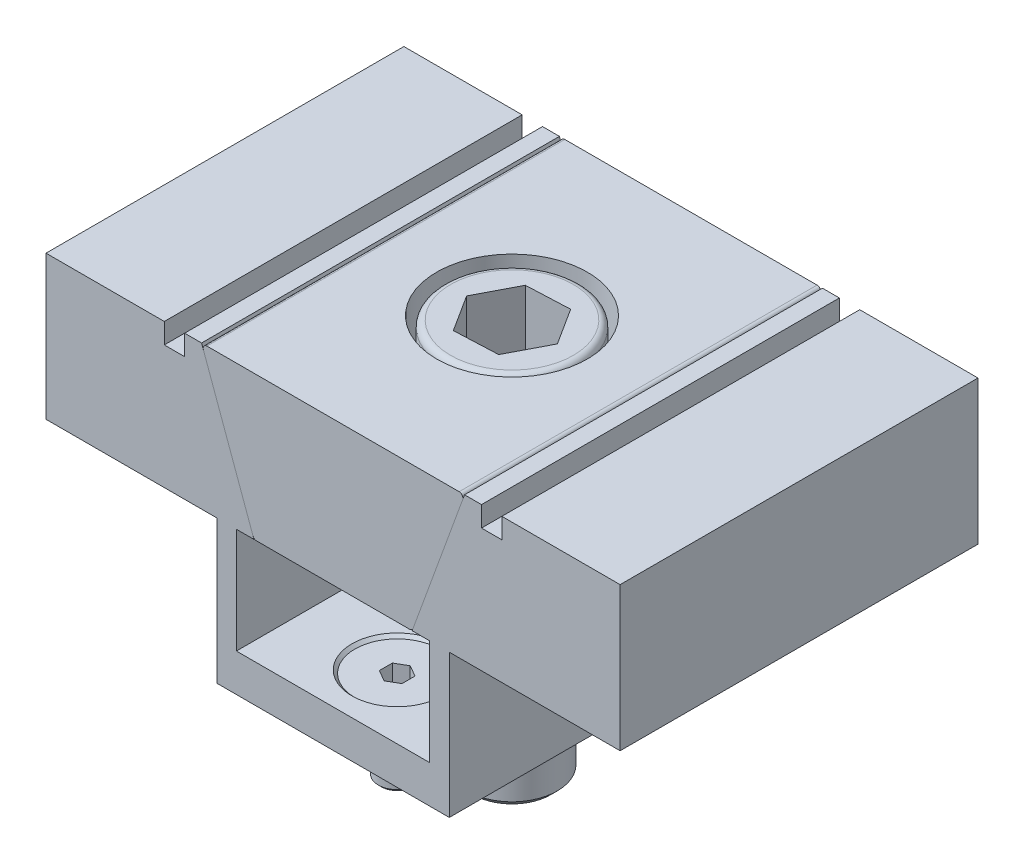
ISO-10303-21;
HEADER;
FILE_DESCRIPTION(('STEP AP214'),'2;1');
FILE_NAME('part.step','',(''),(''),'','','');
FILE_SCHEMA(('AUTOMOTIVE_DESIGN { 1 0 10303 214 1 1 1 1 }'));
ENDSEC;
DATA;
#1=APPLICATION_CONTEXT('core data for automotive mechanical design processes');
#2=APPLICATION_PROTOCOL_DEFINITION('international standard','automotive_design',2000,#1);
#3=PRODUCT_CONTEXT('',#1,'mechanical');
#4=PRODUCT('Part','Part','',(#3));
#5=PRODUCT_RELATED_PRODUCT_CATEGORY('part','',(#4));
#6=PRODUCT_DEFINITION_FORMATION('','',#4);
#7=PRODUCT_DEFINITION_CONTEXT('part definition',#1,'design');
#8=PRODUCT_DEFINITION('design','',#6,#7);
#9=PRODUCT_DEFINITION_SHAPE('','',#8);
#10=(LENGTH_UNIT() NAMED_UNIT(*) SI_UNIT(.MILLI.,.METRE.));
#11=(NAMED_UNIT(*) PLANE_ANGLE_UNIT() SI_UNIT($,.RADIAN.));
#12=(NAMED_UNIT(*) SI_UNIT($,.STERADIAN.) SOLID_ANGLE_UNIT());
#13=UNCERTAINTY_MEASURE_WITH_UNIT(LENGTH_MEASURE(1.E-05),#10,'distance_accuracy_value','');
#14=(GEOMETRIC_REPRESENTATION_CONTEXT(3) GLOBAL_UNCERTAINTY_ASSIGNED_CONTEXT((#13)) GLOBAL_UNIT_ASSIGNED_CONTEXT((#10,
#11,#12)) REPRESENTATION_CONTEXT('',''));
#15=CARTESIAN_POINT('',(0.,0.,0.));
#16=DIRECTION('',(0.,0.,1.));
#17=DIRECTION('',(1.,0.,0.));
#18=AXIS2_PLACEMENT_3D('',#15,#16,#17);
#19=CARTESIAN_POINT('',(0.,-17.4000000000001,13.5079491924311));
#20=DIRECTION('',(0.,1.,0.));
#21=DIRECTION('',(0.,0.,1.));
#22=AXIS2_PLACEMENT_3D('',#19,#20,#21);
#23=PLANE('',#22);
#24=DIRECTION('',(0.866025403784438,0.,0.5));
#25=VECTOR('',#24,1.);
#26=CARTESIAN_POINT('',(-1.5,-17.4000000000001,16.1060254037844));
#27=LINE('',#26,#25);
#28=CARTESIAN_POINT('',(-1.5,-17.4000000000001,16.1060254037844));
#29=VERTEX_POINT('',#28);
#30=CARTESIAN_POINT('',(-0.75,-17.4000000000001,16.5390381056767));
#31=VERTEX_POINT('',#30);
#32=EDGE_CURVE('P0_E174',#29,#31,#27,.T.);
#33=ORIENTED_EDGE('',*,*,#32,.T.);
#34=CARTESIAN_POINT('',(0.,-17.4000000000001,15.24));
#35=DIRECTION('',(0.,1.,0.));
#36=DIRECTION('',(0.,0.,1.));
#37=AXIS2_PLACEMENT_3D('',#34,#35,#36);
#38=CIRCLE('',#37,1.5);
#39=CARTESIAN_POINT('',(-1.5,-17.4000000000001,15.24));
#40=VERTEX_POINT('',#39);
#41=EDGE_CURVE('P0_E11',#31,#40,#38,.F.);
#42=ORIENTED_EDGE('',*,*,#41,.T.);
#43=DIRECTION('',(0.,0.,1.));
#44=VECTOR('',#43,1.);
#45=CARTESIAN_POINT('',(-1.5,-17.4000000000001,14.3739745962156));
#46=LINE('',#45,#44);
#47=EDGE_CURVE('P0_E178',#40,#29,#46,.T.);
#48=ORIENTED_EDGE('',*,*,#47,.T.);
#49=EDGE_LOOP('',(#33,#42,#48));
#50=FACE_BOUND('',#49,.T.);
#51=ADVANCED_FACE('P0_F16',(#50),#23,.T.);
#52=CARTESIAN_POINT('',(-1.5,-17.4000000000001,14.3739745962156));
#53=VERTEX_POINT('',#52);
#54=EDGE_CURVE('P0_E175',#53,#40,#46,.T.);
#55=ORIENTED_EDGE('',*,*,#54,.T.);
#56=CARTESIAN_POINT('',(-0.75,-17.4000000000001,13.9409618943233));
#57=VERTEX_POINT('',#56);
#58=EDGE_CURVE('P0_E25',#40,#57,#38,.F.);
#59=ORIENTED_EDGE('',*,*,#58,.T.);
#60=DIRECTION('',(-0.866025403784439,0.,0.5));
#61=VECTOR('',#60,1.);
#62=CARTESIAN_POINT('',(0.,-17.4000000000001,13.5079491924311));
#63=LINE('',#62,#61);
#64=EDGE_CURVE('P0_E186',#57,#53,#63,.T.);
#65=ORIENTED_EDGE('',*,*,#64,.T.);
#66=EDGE_LOOP('',(#55,#59,#65));
#67=FACE_BOUND('',#66,.T.);
#68=ADVANCED_FACE('P0_F199',(#67),#23,.T.);
#69=CARTESIAN_POINT('',(0.,-17.4000000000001,13.5079491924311));
#70=VERTEX_POINT('',#69);
#71=EDGE_CURVE('P0_E183',#70,#57,#63,.T.);
#72=ORIENTED_EDGE('',*,*,#71,.T.);
#73=CARTESIAN_POINT('',(0.75,-17.4000000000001,13.9409618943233));
#74=VERTEX_POINT('',#73);
#75=EDGE_CURVE('P0_E109',#57,#74,#38,.F.);
#76=ORIENTED_EDGE('',*,*,#75,.T.);
#77=DIRECTION('',(-0.866025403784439,0.,-0.5));
#78=VECTOR('',#77,1.);
#79=CARTESIAN_POINT('',(1.5,-17.4000000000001,14.3739745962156));
#80=LINE('',#79,#78);
#81=EDGE_CURVE('P0_E142',#74,#70,#80,.T.);
#82=ORIENTED_EDGE('',*,*,#81,.T.);
#83=EDGE_LOOP('',(#72,#76,#82));
#84=FACE_BOUND('',#83,.T.);
#85=ADVANCED_FACE('P0_F189',(#84),#23,.T.);
#86=CARTESIAN_POINT('',(1.5,-17.4000000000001,14.3739745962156));
#87=VERTEX_POINT('',#86);
#88=EDGE_CURVE('P0_E108',#87,#74,#80,.T.);
#89=ORIENTED_EDGE('',*,*,#88,.T.);
#90=CARTESIAN_POINT('',(1.5,-17.4000000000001,15.24));
#91=VERTEX_POINT('',#90);
#92=EDGE_CURVE('P0_E95',#74,#91,#38,.F.);
#93=ORIENTED_EDGE('',*,*,#92,.T.);
#94=DIRECTION('',(0.,0.,-1.));
#95=VECTOR('',#94,1.);
#96=CARTESIAN_POINT('',(1.5,-17.4000000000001,16.1060254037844));
#97=LINE('',#96,#95);
#98=EDGE_CURVE('P0_E105',#91,#87,#97,.T.);
#99=ORIENTED_EDGE('',*,*,#98,.T.);
#100=EDGE_LOOP('',(#89,#93,#99));
#101=FACE_BOUND('',#100,.T.);
#102=ADVANCED_FACE('P0_F104',(#101),#23,.T.);
#103=CARTESIAN_POINT('',(1.5,-17.4000000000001,16.1060254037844));
#104=VERTEX_POINT('',#103);
#105=EDGE_CURVE('P0_E114',#104,#91,#97,.T.);
#106=ORIENTED_EDGE('',*,*,#105,.T.);
#107=CARTESIAN_POINT('',(0.,-17.4000000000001,15.24));
#108=DIRECTION('',(0.,-1.,0.));
#109=DIRECTION('',(1.,0.,0.));
#110=AXIS2_PLACEMENT_3D('',#107,#108,#109);
#111=CIRCLE('',#110,1.5);
#112=CARTESIAN_POINT('',(0.749999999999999,-17.4000000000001,16.5390381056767));
#113=VERTEX_POINT('',#112);
#114=EDGE_CURVE('P0_E93',#91,#113,#111,.T.);
#115=ORIENTED_EDGE('',*,*,#114,.T.);
#116=DIRECTION('',(0.866025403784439,0.,-0.5));
#117=VECTOR('',#116,1.);
#118=CARTESIAN_POINT('',(0.,-17.4000000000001,16.9720508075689));
#119=LINE('',#118,#117);
#120=EDGE_CURVE('P0_E119',#113,#104,#119,.T.);
#121=ORIENTED_EDGE('',*,*,#120,.T.);
#122=EDGE_LOOP('',(#106,#115,#121));
#123=FACE_BOUND('',#122,.T.);
#124=ADVANCED_FACE('P0_F118',(#123),#23,.T.);
#125=CARTESIAN_POINT('',(0.,-17.4000000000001,16.9720508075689));
#126=VERTEX_POINT('',#125);
#127=EDGE_CURVE('P0_E116',#126,#113,#119,.T.);
#128=ORIENTED_EDGE('',*,*,#127,.T.);
#129=EDGE_CURVE('P0_E20',#113,#31,#38,.F.);
#130=ORIENTED_EDGE('',*,*,#129,.T.);
#131=EDGE_CURVE('P0_E167',#31,#126,#27,.T.);
#132=ORIENTED_EDGE('',*,*,#131,.T.);
#133=EDGE_LOOP('',(#128,#130,#132));
#134=FACE_BOUND('',#133,.T.);
#135=ADVANCED_FACE('P0_F166',(#134),#23,.T.);
#136=CARTESIAN_POINT('',(0.,-26.4000000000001,15.24));
#137=DIRECTION('',(0.,1.,0.));
#138=DIRECTION('',(0.,0.,1.));
#139=AXIS2_PLACEMENT_3D('',#136,#137,#138);
#140=CYLINDRICAL_SURFACE('',#139,2.5);
#141=CARTESIAN_POINT('',(0.,-26.0000000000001,15.24));
#142=DIRECTION('',(0.,1.,0.));
#143=DIRECTION('',(0.,0.,1.));
#144=AXIS2_PLACEMENT_3D('',#141,#142,#143);
#145=CIRCLE('',#144,2.5);
#146=CARTESIAN_POINT('',(0.,-26.0000000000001,17.74));
#147=VERTEX_POINT('',#146);
#148=EDGE_CURVE('P0_E157',#147,#147,#145,.T.);
#149=ORIENTED_EDGE('',*,*,#148,.T.);
#150=EDGE_LOOP('',(#149));
#151=FACE_BOUND('',#150,.T.);
#152=CARTESIAN_POINT('',(0.,-17.5,15.24));
#153=DIRECTION('',(0.,1.,0.));
#154=DIRECTION('',(-1.,0.,0.));
#155=AXIS2_PLACEMENT_3D('',#152,#153,#154);
#156=CIRCLE('',#155,2.5);
#157=CARTESIAN_POINT('',(-2.5,-17.5,15.24));
#158=VERTEX_POINT('',#157);
#159=EDGE_CURVE('P0_E154',#158,#158,#156,.F.);
#160=ORIENTED_EDGE('',*,*,#159,.T.);
#161=EDGE_LOOP('',(#160));
#162=FACE_BOUND('',#161,.T.);
#163=ADVANCED_FACE('P0_F226',(#151,#162),#140,.T.);
#164=CARTESIAN_POINT('',(0.,-26.4000000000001,15.24));
#165=DIRECTION('',(0.,1.,0.));
#166=DIRECTION('',(0.,0.,1.));
#167=AXIS2_PLACEMENT_3D('',#164,#165,#166);
#168=PLANE('',#167);
#169=CARTESIAN_POINT('',(0.,-26.4000000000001,15.24));
#170=DIRECTION('',(0.,1.,0.));
#171=DIRECTION('',(0.,0.,1.));
#172=AXIS2_PLACEMENT_3D('',#169,#170,#171);
#173=CIRCLE('',#172,2.1);
#174=CARTESIAN_POINT('',(0.,-26.4000000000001,17.34));
#175=VERTEX_POINT('',#174);
#176=EDGE_CURVE('P0_E159',#175,#175,#173,.F.);
#177=ORIENTED_EDGE('',*,*,#176,.T.);
#178=EDGE_LOOP('',(#177));
#179=FACE_BOUND('',#178,.T.);
#180=ADVANCED_FACE('P0_F231',(#179),#168,.F.);
#181=CARTESIAN_POINT('',(0.,-14.4000000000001,15.24));
#182=DIRECTION('',(0.,1.,0.));
#183=DIRECTION('',(-1.,0.,0.));
#184=AXIS2_PLACEMENT_3D('',#181,#182,#183);
#185=CONICAL_SURFACE('',#184,5.6,0.785398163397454);
#186=ORIENTED_EDGE('',*,*,#159,.F.);
#187=EDGE_LOOP('',(#186));
#188=FACE_BOUND('',#187,.T.);
#189=CARTESIAN_POINT('',(0.,-14.4000000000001,15.24));
#190=DIRECTION('',(0.,-1.,0.));
#191=DIRECTION('',(1.,0.,0.));
#192=AXIS2_PLACEMENT_3D('',#189,#190,#191);
#193=CIRCLE('',#192,5.6);
#194=CARTESIAN_POINT('',(5.6,-14.4000000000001,15.24));
#195=VERTEX_POINT('',#194);
#196=EDGE_CURVE('P0_E144',#195,#195,#193,.T.);
#197=ORIENTED_EDGE('',*,*,#196,.T.);
#198=EDGE_LOOP('',(#197));
#199=FACE_BOUND('',#198,.T.);
#200=ADVANCED_FACE('P0_F286',(#188,#199),#185,.T.);
#201=CARTESIAN_POINT('',(0.,-14.4000000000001,15.24));
#202=DIRECTION('',(0.,1.,0.));
#203=DIRECTION('',(0.,0.,1.));
#204=AXIS2_PLACEMENT_3D('',#201,#202,#203);
#205=PLANE('',#204);
#206=DIRECTION('',(-0.866025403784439,0.,-0.5));
#207=VECTOR('',#206,1.);
#208=CARTESIAN_POINT('',(1.5,-14.4000000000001,14.3739745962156));
#209=LINE('',#208,#207);
#210=CARTESIAN_POINT('',(1.5,-14.4000000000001,14.3739745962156));
#211=VERTEX_POINT('',#210);
#212=CARTESIAN_POINT('',(0.,-14.4000000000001,13.5079491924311));
#213=VERTEX_POINT('',#212);
#214=EDGE_CURVE('P0_E38',#211,#213,#209,.T.);
#215=ORIENTED_EDGE('',*,*,#214,.F.);
#216=DIRECTION('',(0.,0.,-1.));
#217=VECTOR('',#216,1.);
#218=CARTESIAN_POINT('',(1.5,-14.4000000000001,16.1060254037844));
#219=LINE('',#218,#217);
#220=CARTESIAN_POINT('',(1.5,-14.4000000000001,16.1060254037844));
#221=VERTEX_POINT('',#220);
#222=EDGE_CURVE('P0_E140',#221,#211,#219,.T.);
#223=ORIENTED_EDGE('',*,*,#222,.F.);
#224=DIRECTION('',(0.866025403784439,0.,-0.5));
#225=VECTOR('',#224,1.);
#226=CARTESIAN_POINT('',(0.,-14.4000000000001,16.9720508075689));
#227=LINE('',#226,#225);
#228=CARTESIAN_POINT('',(0.,-14.4000000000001,16.9720508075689));
#229=VERTEX_POINT('',#228);
#230=EDGE_CURVE('P0_E137',#229,#221,#227,.T.);
#231=ORIENTED_EDGE('',*,*,#230,.F.);
#232=DIRECTION('',(0.866025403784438,0.,0.5));
#233=VECTOR('',#232,1.);
#234=CARTESIAN_POINT('',(-1.5,-14.4000000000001,16.1060254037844));
#235=LINE('',#234,#233);
#236=CARTESIAN_POINT('',(-1.5,-14.4000000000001,16.1060254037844));
#237=VERTEX_POINT('',#236);
#238=EDGE_CURVE('P0_E134',#237,#229,#235,.T.);
#239=ORIENTED_EDGE('',*,*,#238,.F.);
#240=DIRECTION('',(0.,0.,1.));
#241=VECTOR('',#240,1.);
#242=CARTESIAN_POINT('',(-1.5,-14.4000000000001,14.3739745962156));
#243=LINE('',#242,#241);
#244=CARTESIAN_POINT('',(-1.5,-14.4000000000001,14.3739745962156));
#245=VERTEX_POINT('',#244);
#246=EDGE_CURVE('P0_E131',#245,#237,#243,.T.);
#247=ORIENTED_EDGE('',*,*,#246,.F.);
#248=DIRECTION('',(-0.866025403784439,0.,0.5));
#249=VECTOR('',#248,1.);
#250=CARTESIAN_POINT('',(0.,-14.4000000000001,13.5079491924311));
#251=LINE('',#250,#249);
#252=EDGE_CURVE('P0_E128',#213,#245,#251,.T.);
#253=ORIENTED_EDGE('',*,*,#252,.F.);
#254=EDGE_LOOP('',(#215,#223,#231,#239,#247,#253));
#255=FACE_BOUND('',#254,.T.);
#256=ORIENTED_EDGE('',*,*,#196,.F.);
#257=EDGE_LOOP('',(#256));
#258=FACE_BOUND('',#257,.T.);
#259=ADVANCED_FACE('P0_F207',(#255,#258),#205,.T.);
#260=CARTESIAN_POINT('',(0.,-26.0000000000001,15.24));
#261=DIRECTION('',(0.,1.,0.));
#262=DIRECTION('',(0.,0.,1.));
#263=AXIS2_PLACEMENT_3D('',#260,#261,#262);
#264=CONICAL_SURFACE('',#263,2.5,0.78539816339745);
#265=CARTESIAN_POINT('',(0.,-26.4000000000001,17.34));
#266=CARTESIAN_POINT('',(0.,-26.3958333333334,17.3441666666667));
#267=CARTESIAN_POINT('',(0.,-26.3916666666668,17.3483333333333));
#268=CARTESIAN_POINT('',(0.,-26.3833333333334,17.3566666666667));
#269=CARTESIAN_POINT('',(0.,-26.3791666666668,17.3608333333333));
#270=CARTESIAN_POINT('',(0.,-26.3708333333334,17.3691666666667));
#271=CARTESIAN_POINT('',(0.,-26.3666666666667,17.3733333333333));
#272=CARTESIAN_POINT('',(0.,-26.3583333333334,17.3816666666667));
#273=CARTESIAN_POINT('',(0.,-26.3541666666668,17.3858333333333));
#274=CARTESIAN_POINT('',(0.,-26.3458333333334,17.3941666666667));
#275=CARTESIAN_POINT('',(0.,-26.3416666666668,17.3983333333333));
#276=CARTESIAN_POINT('',(0.,-26.3333333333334,17.4066666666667));
#277=CARTESIAN_POINT('',(0.,-26.3291666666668,17.4108333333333));
#278=CARTESIAN_POINT('',(0.,-26.3208333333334,17.4191666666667));
#279=CARTESIAN_POINT('',(0.,-26.3166666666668,17.4233333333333));
#280=CARTESIAN_POINT('',(0.,-26.3083333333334,17.4316666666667));
#281=CARTESIAN_POINT('',(0.,-26.3041666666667,17.4358333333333));
#282=CARTESIAN_POINT('',(0.,-26.2958333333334,17.4441666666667));
#283=CARTESIAN_POINT('',(0.,-26.2916666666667,17.4483333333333));
#284=CARTESIAN_POINT('',(0.,-26.2833333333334,17.4566666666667));
#285=CARTESIAN_POINT('',(0.,-26.2791666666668,17.4608333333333));
#286=CARTESIAN_POINT('',(0.,-26.2708333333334,17.4691666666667));
#287=CARTESIAN_POINT('',(0.,-26.2666666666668,17.4733333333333));
#288=CARTESIAN_POINT('',(0.,-26.2583333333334,17.4816666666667));
#289=CARTESIAN_POINT('',(0.,-26.2541666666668,17.4858333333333));
#290=CARTESIAN_POINT('',(0.,-26.2458333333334,17.4941666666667));
#291=CARTESIAN_POINT('',(0.,-26.2416666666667,17.4983333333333));
#292=CARTESIAN_POINT('',(0.,-26.2333333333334,17.5066666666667));
#293=CARTESIAN_POINT('',(0.,-26.2291666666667,17.5108333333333));
#294=CARTESIAN_POINT('',(0.,-26.2208333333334,17.5191666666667));
#295=CARTESIAN_POINT('',(0.,-26.2166666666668,17.5233333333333));
#296=CARTESIAN_POINT('',(0.,-26.2083333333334,17.5316666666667));
#297=CARTESIAN_POINT('',(0.,-26.2041666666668,17.5358333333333));
#298=CARTESIAN_POINT('',(0.,-26.1958333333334,17.5441666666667));
#299=CARTESIAN_POINT('',(0.,-26.1916666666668,17.5483333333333));
#300=CARTESIAN_POINT('',(0.,-26.1833333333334,17.5566666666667));
#301=CARTESIAN_POINT('',(0.,-26.1791666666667,17.5608333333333));
#302=CARTESIAN_POINT('',(0.,-26.1708333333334,17.5691666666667));
#303=CARTESIAN_POINT('',(0.,-26.1666666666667,17.5733333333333));
#304=CARTESIAN_POINT('',(0.,-26.1583333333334,17.5816666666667));
#305=CARTESIAN_POINT('',(0.,-26.1541666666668,17.5858333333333));
#306=CARTESIAN_POINT('',(0.,-26.1458333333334,17.5941666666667));
#307=CARTESIAN_POINT('',(0.,-26.1416666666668,17.5983333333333));
#308=CARTESIAN_POINT('',(0.,-26.1333333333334,17.6066666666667));
#309=CARTESIAN_POINT('',(0.,-26.1291666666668,17.6108333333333));
#310=CARTESIAN_POINT('',(0.,-26.1208333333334,17.6191666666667));
#311=CARTESIAN_POINT('',(0.,-26.1166666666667,17.6233333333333));
#312=CARTESIAN_POINT('',(0.,-26.1083333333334,17.6316666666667));
#313=CARTESIAN_POINT('',(0.,-26.1041666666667,17.6358333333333));
#314=CARTESIAN_POINT('',(0.,-26.0958333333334,17.6441666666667));
#315=CARTESIAN_POINT('',(0.,-26.0916666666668,17.6483333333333));
#316=CARTESIAN_POINT('',(0.,-26.0833333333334,17.6566666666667));
#317=CARTESIAN_POINT('',(0.,-26.0791666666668,17.6608333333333));
#318=CARTESIAN_POINT('',(0.,-26.0708333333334,17.6691666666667));
#319=CARTESIAN_POINT('',(0.,-26.0666666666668,17.6733333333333));
#320=CARTESIAN_POINT('',(0.,-26.0583333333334,17.6816666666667));
#321=CARTESIAN_POINT('',(0.,-26.0541666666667,17.6858333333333));
#322=CARTESIAN_POINT('',(0.,-26.0458333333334,17.6941666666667));
#323=CARTESIAN_POINT('',(0.,-26.0416666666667,17.6983333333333));
#324=CARTESIAN_POINT('',(0.,-26.0333333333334,17.7066666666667));
#325=CARTESIAN_POINT('',(0.,-26.0291666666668,17.7108333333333));
#326=CARTESIAN_POINT('',(0.,-26.0208333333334,17.7191666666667));
#327=CARTESIAN_POINT('',(0.,-26.0166666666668,17.7233333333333));
#328=CARTESIAN_POINT('',(0.,-26.0083333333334,17.7316666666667));
#329=CARTESIAN_POINT('',(0.,-26.0041666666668,17.7358333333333));
#330=CARTESIAN_POINT('',(0.,-26.0000000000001,17.74));
#331=B_SPLINE_CURVE_WITH_KNOTS('',3,(#265,#266,#267,#268,#269,#270,#271,#272,#273,#274,#275,
#276,#277,#278,#279,#280,#281,#282,#283,#284,#285,#286,#287,#288,#289,#290,#291,#292,#293,#294,
#295,#296,#297,#298,#299,#300,#301,#302,#303,#304,#305,#306,#307,#308,#309,#310,#311,#312,#313,
#314,#315,#316,#317,#318,#319,#320,#321,#322,#323,#324,#325,#326,#327,#328,#329,#330),
.UNSPECIFIED.,.F.,.F.,(4,2,2,2,2,2,2,2,2,2,2,2,2,2,2,2,2,2,2,2,2,2,2,2,2,2,2,2,2,2,2,2,4),(0.,
0.0176776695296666,0.0353553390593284,0.053033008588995,0.0707106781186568,0.0883883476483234,
0.106066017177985,0.123743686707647,0.141421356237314,0.159099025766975,0.176776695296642,
0.194454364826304,0.212132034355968,0.229809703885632,0.247487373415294,0.26516504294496,
0.282842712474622,0.300520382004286,0.318198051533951,0.335875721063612,0.353553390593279,
0.371231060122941,0.388908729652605,0.406586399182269,0.424264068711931,0.441941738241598,
0.459619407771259,0.477297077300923,0.494974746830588,0.512652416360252,0.530330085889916,
0.54800775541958,0.565685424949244),.UNSPECIFIED.);
#332=EDGE_CURVE('P0_BSEAM18',#175,#147,#331,.T.);
#333=ORIENTED_EDGE('',*,*,#176,.F.);
#334=ORIENTED_EDGE('',*,*,#148,.F.);
#335=ORIENTED_EDGE('',*,*,#332,.T.);
#336=ORIENTED_EDGE('',*,*,#332,.F.);
#337=EDGE_LOOP('',(#333,#335,#334,#336));
#338=FACE_BOUND('',#337,.T.);
#339=ADVANCED_FACE('P0_F18',(#338),#264,.T.);
#340=CARTESIAN_POINT('',(1.5,-17.4000000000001,14.3739745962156));
#341=DIRECTION('',(0.5,0.,-0.866025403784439));
#342=DIRECTION('',(-0.866025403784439,0.,-0.5));
#343=AXIS2_PLACEMENT_3D('',#340,#341,#342);
#344=PLANE('',#343);
#345=ORIENTED_EDGE('',*,*,#214,.T.);
#346=DIRECTION('',(0.,1.,0.));
#347=VECTOR('',#346,1.);
#348=CARTESIAN_POINT('',(0.,-17.4000000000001,13.5079491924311));
#349=LINE('',#348,#347);
#350=EDGE_CURVE('P0_E121',#70,#213,#349,.T.);
#351=ORIENTED_EDGE('',*,*,#350,.F.);
#352=ORIENTED_EDGE('',*,*,#81,.F.);
#353=ORIENTED_EDGE('',*,*,#88,.F.);
#354=DIRECTION('',(0.,1.,0.));
#355=VECTOR('',#354,1.);
#356=CARTESIAN_POINT('',(1.5,-17.4000000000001,14.3739745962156));
#357=LINE('',#356,#355);
#358=EDGE_CURVE('P0_E115',#87,#211,#357,.T.);
#359=ORIENTED_EDGE('',*,*,#358,.T.);
#360=EDGE_LOOP('',(#345,#351,#352,#353,#359));
#361=FACE_BOUND('',#360,.T.);
#362=ADVANCED_FACE('P0_F191',(#361),#344,.F.);
#363=CARTESIAN_POINT('',(1.5,-17.4000000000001,16.1060254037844));
#364=DIRECTION('',(1.,0.,0.));
#365=DIRECTION('',(0.,0.,-1.));
#366=AXIS2_PLACEMENT_3D('',#363,#364,#365);
#367=PLANE('',#366);
#368=ORIENTED_EDGE('',*,*,#222,.T.);
#369=ORIENTED_EDGE('',*,*,#358,.F.);
#370=ORIENTED_EDGE('',*,*,#98,.F.);
#371=ORIENTED_EDGE('',*,*,#105,.F.);
#372=DIRECTION('',(0.,1.,0.));
#373=VECTOR('',#372,1.);
#374=CARTESIAN_POINT('',(1.5,-17.4000000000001,16.1060254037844));
#375=LINE('',#374,#373);
#376=EDGE_CURVE('P0_E145',#104,#221,#375,.T.);
#377=ORIENTED_EDGE('',*,*,#376,.T.);
#378=EDGE_LOOP('',(#368,#369,#370,#371,#377));
#379=FACE_BOUND('',#378,.T.);
#380=ADVANCED_FACE('P0_F113',(#379),#367,.F.);
#381=CARTESIAN_POINT('',(0.,-17.4000000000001,16.9720508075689));
#382=DIRECTION('',(0.5,0.,0.866025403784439));
#383=DIRECTION('',(0.866025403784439,0.,-0.5));
#384=AXIS2_PLACEMENT_3D('',#381,#382,#383);
#385=PLANE('',#384);
#386=ORIENTED_EDGE('',*,*,#230,.T.);
#387=ORIENTED_EDGE('',*,*,#376,.F.);
#388=ORIENTED_EDGE('',*,*,#120,.F.);
#389=ORIENTED_EDGE('',*,*,#127,.F.);
#390=DIRECTION('',(0.,1.,0.));
#391=VECTOR('',#390,1.);
#392=CARTESIAN_POINT('',(0.,-17.4000000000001,16.9720508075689));
#393=LINE('',#392,#391);
#394=EDGE_CURVE('P0_E147',#126,#229,#393,.T.);
#395=ORIENTED_EDGE('',*,*,#394,.T.);
#396=EDGE_LOOP('',(#386,#387,#388,#389,#395));
#397=FACE_BOUND('',#396,.T.);
#398=ADVANCED_FACE('P0_F210',(#397),#385,.F.);
#399=CARTESIAN_POINT('',(-1.5,-17.4000000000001,16.1060254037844));
#400=DIRECTION('',(-0.5,0.,0.866025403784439));
#401=DIRECTION('',(0.866025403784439,0.,0.5));
#402=AXIS2_PLACEMENT_3D('',#399,#400,#401);
#403=PLANE('',#402);
#404=ORIENTED_EDGE('',*,*,#238,.T.);
#405=ORIENTED_EDGE('',*,*,#394,.F.);
#406=ORIENTED_EDGE('',*,*,#131,.F.);
#407=ORIENTED_EDGE('',*,*,#32,.F.);
#408=DIRECTION('',(0.,1.,0.));
#409=VECTOR('',#408,1.);
#410=CARTESIAN_POINT('',(-1.5,-17.4000000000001,16.1060254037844));
#411=LINE('',#410,#409);
#412=EDGE_CURVE('P0_E149',#29,#237,#411,.T.);
#413=ORIENTED_EDGE('',*,*,#412,.T.);
#414=EDGE_LOOP('',(#404,#405,#406,#407,#413));
#415=FACE_BOUND('',#414,.T.);
#416=ADVANCED_FACE('P0_F173',(#415),#403,.F.);
#417=CARTESIAN_POINT('',(-1.5,-17.4000000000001,14.3739745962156));
#418=DIRECTION('',(-1.,0.,0.));
#419=DIRECTION('',(0.,0.,1.));
#420=AXIS2_PLACEMENT_3D('',#417,#418,#419);
#421=PLANE('',#420);
#422=ORIENTED_EDGE('',*,*,#246,.T.);
#423=ORIENTED_EDGE('',*,*,#412,.F.);
#424=ORIENTED_EDGE('',*,*,#47,.F.);
#425=ORIENTED_EDGE('',*,*,#54,.F.);
#426=DIRECTION('',(0.,1.,0.));
#427=VECTOR('',#426,1.);
#428=CARTESIAN_POINT('',(-1.5,-17.4000000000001,14.3739745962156));
#429=LINE('',#428,#427);
#430=EDGE_CURVE('P0_E122',#53,#245,#429,.T.);
#431=ORIENTED_EDGE('',*,*,#430,.T.);
#432=EDGE_LOOP('',(#422,#423,#424,#425,#431));
#433=FACE_BOUND('',#432,.T.);
#434=ADVANCED_FACE('P0_F201',(#433),#421,.F.);
#435=CARTESIAN_POINT('',(0.,-17.4000000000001,13.5079491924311));
#436=DIRECTION('',(-0.5,0.,-0.866025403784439));
#437=DIRECTION('',(-0.866025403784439,0.,0.5));
#438=AXIS2_PLACEMENT_3D('',#435,#436,#437);
#439=PLANE('',#438);
#440=ORIENTED_EDGE('',*,*,#252,.T.);
#441=ORIENTED_EDGE('',*,*,#430,.F.);
#442=ORIENTED_EDGE('',*,*,#64,.F.);
#443=ORIENTED_EDGE('',*,*,#71,.F.);
#444=ORIENTED_EDGE('',*,*,#350,.T.);
#445=EDGE_LOOP('',(#440,#441,#442,#443,#444));
#446=FACE_BOUND('',#445,.T.);
#447=ADVANCED_FACE('P0_F90',(#446),#439,.F.);
#448=CARTESIAN_POINT('',(0.,-17.4000000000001,15.24));
#449=DIRECTION('',(0.,1.,0.));
#450=DIRECTION('',(-1.,0.,0.));
#451=AXIS2_PLACEMENT_3D('',#448,#449,#450);
#452=CONICAL_SURFACE('',#451,1.5,1.0471975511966);
#453=CARTESIAN_POINT('',(0.,-18.2660254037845,15.24));
#454=VERTEX_POINT('',#453);
#455=VERTEX_LOOP('',#454);
#456=FACE_BOUND('',#455,.T.);
#457=ORIENTED_EDGE('',*,*,#114,.F.);
#458=ORIENTED_EDGE('',*,*,#92,.F.);
#459=ORIENTED_EDGE('',*,*,#75,.F.);
#460=ORIENTED_EDGE('',*,*,#58,.F.);
#461=ORIENTED_EDGE('',*,*,#41,.F.);
#462=ORIENTED_EDGE('',*,*,#129,.F.);
#463=EDGE_LOOP('',(#457,#458,#459,#460,#461,#462));
#464=FACE_BOUND('',#463,.T.);
#465=ADVANCED_FACE('P0_F88',(#456,#464),#452,.F.);
#466=CLOSED_SHELL('',(#51,#68,#85,#102,#124,#135,#163,#180,#200,#259,#339,#362,#380,#398,#416,
#434,#447,#465));
#467=MANIFOLD_SOLID_BREP('P0_B1',#466);
#468=CARTESIAN_POINT('',(0.,6.60000000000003,0.));
#469=DIRECTION('',(0.,-1.,0.));
#470=DIRECTION('',(-0.887264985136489,0.,-0.461260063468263));
#471=AXIS2_PLACEMENT_3D('',#468,#469,#470);
#472=CYLINDRICAL_SURFACE('',#471,6.);
#473=CARTESIAN_POINT('',(0.,-32.55,0.));
#474=DIRECTION('',(0.,1.,0.));
#475=DIRECTION('',(0.887264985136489,0.,0.461260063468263));
#476=AXIS2_PLACEMENT_3D('',#473,#474,#475);
#477=CIRCLE('',#476,6.);
#478=CARTESIAN_POINT('',(5.32358991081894,-32.55,2.76756038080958));
#479=VERTEX_POINT('',#478);
#480=EDGE_CURVE('P1_E24',#479,#479,#477,.T.);
#481=ORIENTED_EDGE('',*,*,#480,.T.);
#482=EDGE_LOOP('',(#481));
#483=FACE_BOUND('',#482,.T.);
#484=CARTESIAN_POINT('',(0.,6.60000000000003,0.));
#485=DIRECTION('',(0.,1.,0.));
#486=DIRECTION('',(0.887264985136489,0.,0.461260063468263));
#487=AXIS2_PLACEMENT_3D('',#484,#485,#486);
#488=CIRCLE('',#487,6.);
#489=CARTESIAN_POINT('',(5.32358991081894,6.60000000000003,2.76756038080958));
#490=VERTEX_POINT('',#489);
#491=EDGE_CURVE('P1_E126',#490,#490,#488,.T.);
#492=ORIENTED_EDGE('',*,*,#491,.F.);
#493=EDGE_LOOP('',(#492));
#494=FACE_BOUND('',#493,.T.);
#495=ADVANCED_FACE('P1_F16',(#483,#494),#472,.T.);
#496=CARTESIAN_POINT('',(0.,-33.4,0.));
#497=DIRECTION('',(0.,1.,0.));
#498=DIRECTION('',(0.887264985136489,0.,0.461260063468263));
#499=AXIS2_PLACEMENT_3D('',#496,#497,#498);
#500=PLANE('',#499);
#501=CARTESIAN_POINT('',(0.,-33.4,0.));
#502=DIRECTION('',(0.,1.,0.));
#503=DIRECTION('',(0.887264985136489,0.,0.461260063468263));
#504=AXIS2_PLACEMENT_3D('',#501,#502,#503);
#505=CIRCLE('',#504,5.15000000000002);
#506=CARTESIAN_POINT('',(4.56941467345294,-33.4,2.37548932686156));
#507=VERTEX_POINT('',#506);
#508=EDGE_CURVE('P1_E11',#507,#507,#505,.F.);
#509=ORIENTED_EDGE('',*,*,#508,.T.);
#510=EDGE_LOOP('',(#509));
#511=FACE_BOUND('',#510,.T.);
#512=ADVANCED_FACE('P1_F149',(#511),#500,.F.);
#513=CARTESIAN_POINT('',(0.,6.60000000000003,0.));
#514=DIRECTION('',(0.,1.,0.));
#515=DIRECTION('',(0.887264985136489,0.,0.461260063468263));
#516=AXIS2_PLACEMENT_3D('',#513,#514,#515);
#517=PLANE('',#516);
#518=CARTESIAN_POINT('',(0.,6.60000000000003,0.));
#519=DIRECTION('',(0.,1.,0.));
#520=DIRECTION('',(0.887264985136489,0.,0.461260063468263));
#521=AXIS2_PLACEMENT_3D('',#518,#519,#520);
#522=CIRCLE('',#521,9.);
#523=CARTESIAN_POINT('',(7.98538486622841,6.60000000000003,4.15134057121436));
#524=VERTEX_POINT('',#523);
#525=EDGE_CURVE('P1_E118',#524,#524,#522,.T.);
#526=ORIENTED_EDGE('',*,*,#525,.F.);
#527=EDGE_LOOP('',(#526));
#528=FACE_BOUND('',#527,.T.);
#529=ORIENTED_EDGE('',*,*,#491,.T.);
#530=EDGE_LOOP('',(#529));
#531=FACE_BOUND('',#530,.T.);
#532=ADVANCED_FACE('P1_F154',(#528,#531),#517,.F.);
#533=CARTESIAN_POINT('',(0.,18.6,0.));
#534=DIRECTION('',(0.,-1.,0.));
#535=DIRECTION('',(-0.887264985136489,0.,-0.461260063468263));
#536=AXIS2_PLACEMENT_3D('',#533,#534,#535);
#537=CYLINDRICAL_SURFACE('',#536,9.);
#538=CARTESIAN_POINT('',(0.,17.75,0.));
#539=DIRECTION('',(0.,1.,0.));
#540=DIRECTION('',(0.887264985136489,0.,0.461260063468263));
#541=AXIS2_PLACEMENT_3D('',#538,#539,#540);
#542=CIRCLE('',#541,9.);
#543=CARTESIAN_POINT('',(7.98538486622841,17.75,4.15134057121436));
#544=VERTEX_POINT('',#543);
#545=EDGE_CURVE('P1_E132',#544,#544,#542,.F.);
#546=ORIENTED_EDGE('',*,*,#545,.T.);
#547=EDGE_LOOP('',(#546));
#548=FACE_BOUND('',#547,.T.);
#549=ORIENTED_EDGE('',*,*,#525,.T.);
#550=EDGE_LOOP('',(#549));
#551=FACE_BOUND('',#550,.T.);
#552=ADVANCED_FACE('P1_F158',(#548,#551),#537,.T.);
#553=CARTESIAN_POINT('',(0.,18.6,0.));
#554=DIRECTION('',(0.,1.,0.));
#555=DIRECTION('',(0.887264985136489,0.,0.461260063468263));
#556=AXIS2_PLACEMENT_3D('',#553,#554,#555);
#557=PLANE('',#556);
#558=CARTESIAN_POINT('',(0.,18.6,0.));
#559=DIRECTION('',(0.,1.,0.));
#560=DIRECTION('',(0.887264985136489,0.,0.461260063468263));
#561=AXIS2_PLACEMENT_3D('',#558,#559,#560);
#562=CIRCLE('',#561,8.15);
#563=CARTESIAN_POINT('',(7.23120962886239,18.6,3.75926951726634));
#564=VERTEX_POINT('',#563);
#565=EDGE_CURVE('P1_E129',#564,#564,#562,.T.);
#566=ORIENTED_EDGE('',*,*,#565,.T.);
#567=EDGE_LOOP('',(#566));
#568=FACE_BOUND('',#567,.T.);
#569=DIRECTION('',(-0.999024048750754,0.,0.044169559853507));
#570=VECTOR('',#569,1.);
#571=CARTESIAN_POINT('',(2.66308621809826,18.6,-5.12262678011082));
#572=LINE('',#571,#570);
#573=CARTESIAN_POINT('',(2.66308621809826,18.6,-5.12262678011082));
#574=VERTEX_POINT('',#573);
#575=CARTESIAN_POINT('',(-3.10478181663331,18.6,-4.86761370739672));
#576=VERTEX_POINT('',#575);
#577=EDGE_CURVE('P1_E31',#574,#576,#572,.T.);
#578=ORIENTED_EDGE('',*,*,#577,.F.);
#579=DIRECTION('',(-0.537763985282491,0.,-0.843095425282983));
#580=VECTOR('',#579,1.);
#581=CARTESIAN_POINT('',(5.76786803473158,18.6,-0.255013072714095));
#582=LINE('',#581,#580);
#583=CARTESIAN_POINT('',(5.76786803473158,18.6,-0.255013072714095));
#584=VERTEX_POINT('',#583);
#585=EDGE_CURVE('P1_E114',#584,#574,#582,.T.);
#586=ORIENTED_EDGE('',*,*,#585,.F.);
#587=DIRECTION('',(0.461260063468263,0.,-0.887264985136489));
#588=VECTOR('',#587,1.);
#589=CARTESIAN_POINT('',(3.10478181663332,18.6,4.86761370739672));
#590=LINE('',#589,#588);
#591=CARTESIAN_POINT('',(3.10478181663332,18.6,4.86761370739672));
#592=VERTEX_POINT('',#591);
#593=EDGE_CURVE('P1_E112',#592,#584,#590,.T.);
#594=ORIENTED_EDGE('',*,*,#593,.F.);
#595=DIRECTION('',(0.999024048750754,0.,-0.0441695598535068));
#596=VECTOR('',#595,1.);
#597=CARTESIAN_POINT('',(-2.66308621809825,18.6,5.12262678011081));
#598=LINE('',#597,#596);
#599=CARTESIAN_POINT('',(-2.66308621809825,18.6,5.12262678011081));
#600=VERTEX_POINT('',#599);
#601=EDGE_CURVE('P1_E79',#600,#592,#598,.T.);
#602=ORIENTED_EDGE('',*,*,#601,.F.);
#603=DIRECTION('',(0.537763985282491,0.,0.843095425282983));
#604=VECTOR('',#603,1.);
#605=CARTESIAN_POINT('',(-5.76786803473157,18.6,0.255013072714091));
#606=LINE('',#605,#604);
#607=CARTESIAN_POINT('',(-5.76786803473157,18.6,0.255013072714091));
#608=VERTEX_POINT('',#607);
#609=EDGE_CURVE('P1_E108',#608,#600,#606,.T.);
#610=ORIENTED_EDGE('',*,*,#609,.F.);
#611=DIRECTION('',(-0.461260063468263,0.,0.887264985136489));
#612=VECTOR('',#611,1.);
#613=CARTESIAN_POINT('',(-3.10478181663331,18.6,-4.86761370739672));
#614=LINE('',#613,#612);
#615=EDGE_CURVE('P1_E105',#576,#608,#614,.T.);
#616=ORIENTED_EDGE('',*,*,#615,.F.);
#617=EDGE_LOOP('',(#578,#586,#594,#602,#610,#616));
#618=FACE_BOUND('',#617,.T.);
#619=ADVANCED_FACE('P1_F161',(#568,#618),#557,.T.);
#620=CARTESIAN_POINT('',(2.66308621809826,8.60000000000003,-5.12262678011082));
#621=DIRECTION('',(-0.044169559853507,0.,-0.999024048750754));
#622=DIRECTION('',(-0.999024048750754,0.,0.044169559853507));
#623=AXIS2_PLACEMENT_3D('',#620,#621,#622);
#624=PLANE('',#623);
#625=ORIENTED_EDGE('',*,*,#577,.T.);
#626=DIRECTION('',(0.,1.,0.));
#627=VECTOR('',#626,1.);
#628=CARTESIAN_POINT('',(-3.10478181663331,8.60000000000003,-4.86761370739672));
#629=LINE('',#628,#627);
#630=CARTESIAN_POINT('',(-3.10478181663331,8.60000000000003,-4.86761370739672));
#631=VERTEX_POINT('',#630);
#632=EDGE_CURVE('P1_E61',#631,#576,#629,.T.);
#633=ORIENTED_EDGE('',*,*,#632,.F.);
#634=DIRECTION('',(-0.999024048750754,0.,0.044169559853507));
#635=VECTOR('',#634,1.);
#636=CARTESIAN_POINT('',(2.66308621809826,8.60000000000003,-5.12262678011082));
#637=LINE('',#636,#635);
#638=CARTESIAN_POINT('',(2.66308621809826,8.60000000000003,-5.12262678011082));
#639=VERTEX_POINT('',#638);
#640=EDGE_CURVE('P1_E116',#639,#631,#637,.T.);
#641=ORIENTED_EDGE('',*,*,#640,.F.);
#642=DIRECTION('',(0.,1.,0.));
#643=VECTOR('',#642,1.);
#644=CARTESIAN_POINT('',(2.66308621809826,8.60000000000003,-5.12262678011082));
#645=LINE('',#644,#643);
#646=EDGE_CURVE('P1_E39',#639,#574,#645,.T.);
#647=ORIENTED_EDGE('',*,*,#646,.T.);
#648=EDGE_LOOP('',(#625,#633,#641,#647));
#649=FACE_BOUND('',#648,.T.);
#650=ADVANCED_FACE('P1_F168',(#649),#624,.F.);
#651=CARTESIAN_POINT('',(5.76786803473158,8.60000000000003,-0.255013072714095));
#652=DIRECTION('',(0.843095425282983,0.,-0.537763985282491));
#653=DIRECTION('',(-0.537763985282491,0.,-0.843095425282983));
#654=AXIS2_PLACEMENT_3D('',#651,#652,#653);
#655=PLANE('',#654);
#656=ORIENTED_EDGE('',*,*,#585,.T.);
#657=ORIENTED_EDGE('',*,*,#646,.F.);
#658=DIRECTION('',(-0.537763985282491,0.,-0.843095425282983));
#659=VECTOR('',#658,1.);
#660=CARTESIAN_POINT('',(5.76786803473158,8.60000000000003,-0.255013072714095));
#661=LINE('',#660,#659);
#662=CARTESIAN_POINT('',(5.76786803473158,8.60000000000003,-0.255013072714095));
#663=VERTEX_POINT('',#662);
#664=EDGE_CURVE('P1_E91',#663,#639,#661,.T.);
#665=ORIENTED_EDGE('',*,*,#664,.F.);
#666=DIRECTION('',(0.,1.,0.));
#667=VECTOR('',#666,1.);
#668=CARTESIAN_POINT('',(5.76786803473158,8.60000000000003,-0.255013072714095));
#669=LINE('',#668,#667);
#670=EDGE_CURVE('P1_E83',#663,#584,#669,.T.);
#671=ORIENTED_EDGE('',*,*,#670,.T.);
#672=EDGE_LOOP('',(#656,#657,#665,#671));
#673=FACE_BOUND('',#672,.T.);
#674=ADVANCED_FACE('P1_F172',(#673),#655,.F.);
#675=CARTESIAN_POINT('',(3.10478181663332,8.60000000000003,4.86761370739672));
#676=DIRECTION('',(0.887264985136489,0.,0.461260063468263));
#677=DIRECTION('',(0.461260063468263,0.,-0.887264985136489));
#678=AXIS2_PLACEMENT_3D('',#675,#676,#677);
#679=PLANE('',#678);
#680=ORIENTED_EDGE('',*,*,#593,.T.);
#681=ORIENTED_EDGE('',*,*,#670,.F.);
#682=DIRECTION('',(0.461260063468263,0.,-0.887264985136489));
#683=VECTOR('',#682,1.);
#684=CARTESIAN_POINT('',(3.10478181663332,8.60000000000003,4.86761370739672));
#685=LINE('',#684,#683);
#686=CARTESIAN_POINT('',(3.10478181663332,8.60000000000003,4.86761370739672));
#687=VERTEX_POINT('',#686);
#688=EDGE_CURVE('P1_E87',#687,#663,#685,.T.);
#689=ORIENTED_EDGE('',*,*,#688,.F.);
#690=DIRECTION('',(0.,1.,0.));
#691=VECTOR('',#690,1.);
#692=CARTESIAN_POINT('',(3.10478181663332,8.60000000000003,4.86761370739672));
#693=LINE('',#692,#691);
#694=EDGE_CURVE('P1_E72',#687,#592,#693,.T.);
#695=ORIENTED_EDGE('',*,*,#694,.T.);
#696=EDGE_LOOP('',(#680,#681,#689,#695));
#697=FACE_BOUND('',#696,.T.);
#698=ADVANCED_FACE('P1_F88',(#697),#679,.F.);
#699=CARTESIAN_POINT('',(-2.66308621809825,8.60000000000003,5.12262678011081));
#700=DIRECTION('',(0.0441695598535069,0.,0.999024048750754));
#701=DIRECTION('',(0.999024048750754,0.,-0.0441695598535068));
#702=AXIS2_PLACEMENT_3D('',#699,#700,#701);
#703=PLANE('',#702);
#704=ORIENTED_EDGE('',*,*,#601,.T.);
#705=ORIENTED_EDGE('',*,*,#694,.F.);
#706=DIRECTION('',(0.999024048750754,0.,-0.0441695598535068));
#707=VECTOR('',#706,1.);
#708=CARTESIAN_POINT('',(-2.66308621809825,8.60000000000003,5.12262678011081));
#709=LINE('',#708,#707);
#710=CARTESIAN_POINT('',(-2.66308621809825,8.60000000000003,5.12262678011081));
#711=VERTEX_POINT('',#710);
#712=EDGE_CURVE('P1_E76',#711,#687,#709,.T.);
#713=ORIENTED_EDGE('',*,*,#712,.F.);
#714=DIRECTION('',(0.,1.,0.));
#715=VECTOR('',#714,1.);
#716=CARTESIAN_POINT('',(-2.66308621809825,8.60000000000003,5.12262678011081));
#717=LINE('',#716,#715);
#718=EDGE_CURVE('P1_E84',#711,#600,#717,.T.);
#719=ORIENTED_EDGE('',*,*,#718,.T.);
#720=EDGE_LOOP('',(#704,#705,#713,#719));
#721=FACE_BOUND('',#720,.T.);
#722=ADVANCED_FACE('P1_F74',(#721),#703,.F.);
#723=CARTESIAN_POINT('',(-5.76786803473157,8.60000000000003,0.255013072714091));
#724=DIRECTION('',(-0.843095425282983,0.,0.537763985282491));
#725=DIRECTION('',(0.537763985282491,0.,0.843095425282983));
#726=AXIS2_PLACEMENT_3D('',#723,#724,#725);
#727=PLANE('',#726);
#728=ORIENTED_EDGE('',*,*,#609,.T.);
#729=ORIENTED_EDGE('',*,*,#718,.F.);
#730=DIRECTION('',(0.537763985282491,0.,0.843095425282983));
#731=VECTOR('',#730,1.);
#732=CARTESIAN_POINT('',(-5.76786803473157,8.60000000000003,0.255013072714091));
#733=LINE('',#732,#731);
#734=CARTESIAN_POINT('',(-5.76786803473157,8.60000000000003,0.255013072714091));
#735=VERTEX_POINT('',#734);
#736=EDGE_CURVE('P1_E97',#735,#711,#733,.T.);
#737=ORIENTED_EDGE('',*,*,#736,.F.);
#738=DIRECTION('',(0.,1.,0.));
#739=VECTOR('',#738,1.);
#740=CARTESIAN_POINT('',(-5.76786803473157,8.60000000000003,0.255013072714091));
#741=LINE('',#740,#739);
#742=EDGE_CURVE('P1_E121',#735,#608,#741,.T.);
#743=ORIENTED_EDGE('',*,*,#742,.T.);
#744=EDGE_LOOP('',(#728,#729,#737,#743));
#745=FACE_BOUND('',#744,.T.);
#746=ADVANCED_FACE('P1_F176',(#745),#727,.F.);
#747=CARTESIAN_POINT('',(-3.10478181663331,8.60000000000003,-4.86761370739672));
#748=DIRECTION('',(-0.887264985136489,0.,-0.461260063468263));
#749=DIRECTION('',(-0.461260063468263,0.,0.887264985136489));
#750=AXIS2_PLACEMENT_3D('',#747,#748,#749);
#751=PLANE('',#750);
#752=ORIENTED_EDGE('',*,*,#615,.T.);
#753=ORIENTED_EDGE('',*,*,#742,.F.);
#754=DIRECTION('',(-0.461260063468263,0.,0.887264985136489));
#755=VECTOR('',#754,1.);
#756=CARTESIAN_POINT('',(-3.10478181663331,8.60000000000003,-4.86761370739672));
#757=LINE('',#756,#755);
#758=EDGE_CURVE('P1_E99',#631,#735,#757,.T.);
#759=ORIENTED_EDGE('',*,*,#758,.F.);
#760=ORIENTED_EDGE('',*,*,#632,.T.);
#761=EDGE_LOOP('',(#752,#753,#759,#760));
#762=FACE_BOUND('',#761,.T.);
#763=ADVANCED_FACE('P1_F173',(#762),#751,.F.);
#764=CARTESIAN_POINT('',(-3.10478181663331,8.60000000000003,-4.86761370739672));
#765=DIRECTION('',(0.,1.,0.));
#766=DIRECTION('',(0.887264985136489,0.,0.461260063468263));
#767=AXIS2_PLACEMENT_3D('',#764,#765,#766);
#768=PLANE('',#767);
#769=ORIENTED_EDGE('',*,*,#640,.T.);
#770=ORIENTED_EDGE('',*,*,#758,.T.);
#771=ORIENTED_EDGE('',*,*,#736,.T.);
#772=ORIENTED_EDGE('',*,*,#712,.T.);
#773=ORIENTED_EDGE('',*,*,#688,.T.);
#774=ORIENTED_EDGE('',*,*,#664,.T.);
#775=EDGE_LOOP('',(#769,#770,#771,#772,#773,#774));
#776=FACE_BOUND('',#775,.T.);
#777=ADVANCED_FACE('P1_F94',(#776),#768,.T.);
#778=CARTESIAN_POINT('',(0.,17.75,0.));
#779=DIRECTION('',(0.,1.,0.));
#780=DIRECTION('',(0.887264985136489,0.,0.461260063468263));
#781=AXIS2_PLACEMENT_3D('',#778,#779,#780);
#782=TOROIDAL_SURFACE('',#781,8.15,0.85);
#783=ORIENTED_EDGE('',*,*,#545,.F.);
#784=EDGE_LOOP('',(#783));
#785=FACE_BOUND('',#784,.T.);
#786=ORIENTED_EDGE('',*,*,#565,.F.);
#787=EDGE_LOOP('',(#786));
#788=FACE_BOUND('',#787,.T.);
#789=ADVANCED_FACE('P1_F140',(#785,#788),#782,.T.);
#790=CARTESIAN_POINT('',(0.,-32.55,0.));
#791=DIRECTION('',(0.,1.,0.));
#792=DIRECTION('',(0.887264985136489,0.,0.461260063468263));
#793=AXIS2_PLACEMENT_3D('',#790,#791,#792);
#794=CONICAL_SURFACE('',#793,6.,0.785398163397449);
#795=ORIENTED_EDGE('',*,*,#508,.F.);
#796=EDGE_LOOP('',(#795));
#797=FACE_BOUND('',#796,.T.);
#798=ORIENTED_EDGE('',*,*,#480,.F.);
#799=EDGE_LOOP('',(#798));
#800=FACE_BOUND('',#799,.T.);
#801=ADVANCED_FACE('P1_F18',(#797,#800),#794,.T.);
#802=CLOSED_SHELL('',(#495,#512,#532,#552,#619,#650,#674,#698,#722,#746,#763,#777,#789,#801));
#803=MANIFOLD_SOLID_BREP('P1_B1',#802);
#804=CARTESIAN_POINT('',(0.,0.,0.));
#805=DIRECTION('',(0.,1.,0.));
#806=DIRECTION('',(0.,0.,1.));
#807=AXIS2_PLACEMENT_3D('',#804,#805,#806);
#808=CYLINDRICAL_SURFACE('',#807,7.);
#809=CARTESIAN_POINT('',(0.,0.,0.));
#810=DIRECTION('',(0.,1.,0.));
#811=DIRECTION('',(0.,0.,1.));
#812=AXIS2_PLACEMENT_3D('',#809,#810,#811);
#813=CIRCLE('',#812,7.);
#814=CARTESIAN_POINT('',(0.,0.,7.));
#815=VERTEX_POINT('',#814);
#816=EDGE_CURVE('P2_E120',#815,#815,#813,.T.);
#817=ORIENTED_EDGE('',*,*,#816,.F.);
#818=EDGE_LOOP('',(#817));
#819=FACE_BOUND('',#818,.T.);
#820=CARTESIAN_POINT('',(0.,6.6,0.));
#821=DIRECTION('',(0.,1.,0.));
#822=DIRECTION('',(0.,0.,1.));
#823=AXIS2_PLACEMENT_3D('',#820,#821,#822);
#824=CIRCLE('',#823,7.);
#825=CARTESIAN_POINT('',(0.,6.6,7.));
#826=VERTEX_POINT('',#825);
#827=EDGE_CURVE('P2_E117',#826,#826,#824,.F.);
#828=ORIENTED_EDGE('',*,*,#827,.F.);
#829=EDGE_LOOP('',(#828));
#830=FACE_BOUND('',#829,.T.);
#831=ADVANCED_FACE('P2_F16',(#819,#830),#808,.F.);
#832=CARTESIAN_POINT('',(-10.5,0.,23.75));
#833=DIRECTION('',(0.939692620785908,0.342020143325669,0.));
#834=DIRECTION('',(-0.342020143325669,0.939692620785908,0.));
#835=AXIS2_PLACEMENT_3D('',#832,#833,#834);
#836=PLANE('',#835);
#837=DIRECTION('',(0.342020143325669,-0.939692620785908,0.));
#838=VECTOR('',#837,1.);
#839=CARTESIAN_POINT('',(-10.5,0.,-23.75));
#840=LINE('',#839,#838);
#841=CARTESIAN_POINT('',(-17.2076037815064,18.4289899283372,-23.75));
#842=VERTEX_POINT('',#841);
#843=CARTESIAN_POINT('',(-10.6197425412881,0.328989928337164,-23.75));
#844=VERTEX_POINT('',#843);
#845=EDGE_CURVE('P2_E113',#842,#844,#840,.T.);
#846=ORIENTED_EDGE('',*,*,#845,.T.);
#847=DIRECTION('',(0.,0.,-1.));
#848=VECTOR('',#847,1.);
#849=CARTESIAN_POINT('',(-10.6197425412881,0.328989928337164,23.75));
#850=LINE('',#849,#848);
#851=CARTESIAN_POINT('',(-10.6197425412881,0.328989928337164,23.75));
#852=VERTEX_POINT('',#851);
#853=EDGE_CURVE('P2_E140',#844,#852,#850,.F.);
#854=ORIENTED_EDGE('',*,*,#853,.T.);
#855=DIRECTION('',(0.342020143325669,-0.939692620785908,0.));
#856=VECTOR('',#855,1.);
#857=CARTESIAN_POINT('',(-10.5,0.,23.75));
#858=LINE('',#857,#856);
#859=CARTESIAN_POINT('',(-17.2076037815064,18.4289899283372,23.75));
#860=VERTEX_POINT('',#859);
#861=EDGE_CURVE('P2_E111',#860,#852,#858,.T.);
#862=ORIENTED_EDGE('',*,*,#861,.F.);
#863=DIRECTION('',(0.,0.,-1.));
#864=VECTOR('',#863,1.);
#865=CARTESIAN_POINT('',(-17.2076037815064,18.4289899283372,23.75));
#866=LINE('',#865,#864);
#867=EDGE_CURVE('P2_E137',#860,#842,#866,.T.);
#868=ORIENTED_EDGE('',*,*,#867,.T.);
#869=EDGE_LOOP('',(#846,#854,#862,#868));
#870=FACE_BOUND('',#869,.T.);
#871=ADVANCED_FACE('P2_F146',(#870),#836,.F.);
#872=CARTESIAN_POINT('',(10.5,0.,23.75));
#873=DIRECTION('',(0.,1.,0.));
#874=DIRECTION('',(0.,0.,1.));
#875=AXIS2_PLACEMENT_3D('',#872,#873,#874);
#876=PLANE('',#875);
#877=ORIENTED_EDGE('',*,*,#816,.T.);
#878=EDGE_LOOP('',(#877));
#879=FACE_BOUND('',#878,.T.);
#880=DIRECTION('',(1.,0.,0.));
#881=VECTOR('',#880,1.);
#882=CARTESIAN_POINT('',(10.5,0.,-23.75));
#883=LINE('',#882,#881);
#884=CARTESIAN_POINT('',(-10.1498962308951,0.,-23.75));
#885=VERTEX_POINT('',#884);
#886=CARTESIAN_POINT('',(10.1498962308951,0.,-23.75));
#887=VERTEX_POINT('',#886);
#888=EDGE_CURVE('P2_E109',#885,#887,#883,.T.);
#889=ORIENTED_EDGE('',*,*,#888,.T.);
#890=DIRECTION('',(0.,0.,-1.));
#891=VECTOR('',#890,1.);
#892=CARTESIAN_POINT('',(10.1498962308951,0.,23.75));
#893=LINE('',#892,#891);
#894=CARTESIAN_POINT('',(10.1498962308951,0.,23.75));
#895=VERTEX_POINT('',#894);
#896=EDGE_CURVE('P2_E87',#887,#895,#893,.F.);
#897=ORIENTED_EDGE('',*,*,#896,.T.);
#898=DIRECTION('',(1.,0.,0.));
#899=VECTOR('',#898,1.);
#900=CARTESIAN_POINT('',(10.5,0.,23.75));
#901=LINE('',#900,#899);
#902=CARTESIAN_POINT('',(-10.1498962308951,0.,23.75));
#903=VERTEX_POINT('',#902);
#904=EDGE_CURVE('P2_E155',#903,#895,#901,.T.);
#905=ORIENTED_EDGE('',*,*,#904,.F.);
#906=DIRECTION('',(0.,0.,-1.));
#907=VECTOR('',#906,1.);
#908=CARTESIAN_POINT('',(-10.1498962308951,0.,23.75));
#909=LINE('',#908,#907);
#910=EDGE_CURVE('P2_E92',#903,#885,#909,.T.);
#911=ORIENTED_EDGE('',*,*,#910,.T.);
#912=EDGE_LOOP('',(#889,#897,#905,#911));
#913=FACE_BOUND('',#912,.T.);
#914=ADVANCED_FACE('P2_F160',(#879,#913),#876,.F.);
#915=CARTESIAN_POINT('',(10.5,0.,23.75));
#916=DIRECTION('',(-0.939692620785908,0.342020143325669,0.));
#917=DIRECTION('',(-0.342020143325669,-0.939692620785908,0.));
#918=AXIS2_PLACEMENT_3D('',#915,#916,#917);
#919=PLANE('',#918);
#920=DIRECTION('',(0.342020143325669,0.939692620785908,0.));
#921=VECTOR('',#920,1.);
#922=CARTESIAN_POINT('',(10.5,0.,23.75));
#923=LINE('',#922,#921);
#924=CARTESIAN_POINT('',(10.6197425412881,0.328989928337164,23.75));
#925=VERTEX_POINT('',#924);
#926=CARTESIAN_POINT('',(17.2076037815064,18.4289899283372,23.75));
#927=VERTEX_POINT('',#926);
#928=EDGE_CURVE('P2_E101',#925,#927,#923,.T.);
#929=ORIENTED_EDGE('',*,*,#928,.F.);
#930=DIRECTION('',(0.,0.,-1.));
#931=VECTOR('',#930,1.);
#932=CARTESIAN_POINT('',(10.6197425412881,0.328989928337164,23.75));
#933=LINE('',#932,#931);
#934=CARTESIAN_POINT('',(10.6197425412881,0.328989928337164,-23.75));
#935=VERTEX_POINT('',#934);
#936=EDGE_CURVE('P2_E86',#925,#935,#933,.T.);
#937=ORIENTED_EDGE('',*,*,#936,.T.);
#938=DIRECTION('',(0.342020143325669,0.939692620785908,0.));
#939=VECTOR('',#938,1.);
#940=CARTESIAN_POINT('',(10.5,0.,-23.75));
#941=LINE('',#940,#939);
#942=CARTESIAN_POINT('',(17.2076037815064,18.4289899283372,-23.75));
#943=VERTEX_POINT('',#942);
#944=EDGE_CURVE('P2_E99',#935,#943,#941,.T.);
#945=ORIENTED_EDGE('',*,*,#944,.T.);
#946=DIRECTION('',(0.,0.,-1.));
#947=VECTOR('',#946,1.);
#948=CARTESIAN_POINT('',(17.2076037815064,18.4289899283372,23.75));
#949=LINE('',#948,#947);
#950=EDGE_CURVE('P2_E103',#943,#927,#949,.F.);
#951=ORIENTED_EDGE('',*,*,#950,.T.);
#952=EDGE_LOOP('',(#929,#937,#945,#951));
#953=FACE_BOUND('',#952,.T.);
#954=ADVANCED_FACE('P2_F98',(#953),#919,.F.);
#955=CARTESIAN_POINT('',(-17.4518314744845,19.1,23.75));
#956=DIRECTION('',(0.,-1.,0.));
#957=DIRECTION('',(0.,0.,-1.));
#958=AXIS2_PLACEMENT_3D('',#955,#956,#957);
#959=PLANE('',#958);
#960=CARTESIAN_POINT('',(0.,19.1,0.));
#961=DIRECTION('',(0.,1.,0.));
#962=DIRECTION('',(0.,0.,1.));
#963=AXIS2_PLACEMENT_3D('',#960,#961,#962);
#964=CIRCLE('',#963,10.);
#965=CARTESIAN_POINT('',(0.,19.1,10.));
#966=VERTEX_POINT('',#965);
#967=EDGE_CURVE('P2_E167',#966,#966,#964,.T.);
#968=ORIENTED_EDGE('',*,*,#967,.F.);
#969=EDGE_LOOP('',(#968));
#970=FACE_BOUND('',#969,.T.);
#971=DIRECTION('',(-1.,0.,0.));
#972=VECTOR('',#971,1.);
#973=CARTESIAN_POINT('',(-17.4518314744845,19.1,23.75));
#974=LINE('',#973,#972);
#975=CARTESIAN_POINT('',(16.7377574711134,19.1,23.75));
#976=VERTEX_POINT('',#975);
#977=CARTESIAN_POINT('',(-16.7377574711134,19.1,23.75));
#978=VERTEX_POINT('',#977);
#979=EDGE_CURVE('P2_E122',#976,#978,#974,.T.);
#980=ORIENTED_EDGE('',*,*,#979,.F.);
#981=DIRECTION('',(0.,0.,-1.));
#982=VECTOR('',#981,1.);
#983=CARTESIAN_POINT('',(16.7377574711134,19.1,23.75));
#984=LINE('',#983,#982);
#985=CARTESIAN_POINT('',(16.7377574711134,19.1,-23.75));
#986=VERTEX_POINT('',#985);
#987=EDGE_CURVE('P2_E11',#976,#986,#984,.T.);
#988=ORIENTED_EDGE('',*,*,#987,.T.);
#989=DIRECTION('',(-1.,0.,0.));
#990=VECTOR('',#989,1.);
#991=CARTESIAN_POINT('',(-17.4518314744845,19.1,-23.75));
#992=LINE('',#991,#990);
#993=CARTESIAN_POINT('',(-16.7377574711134,19.1,-23.75));
#994=VERTEX_POINT('',#993);
#995=EDGE_CURVE('P2_E108',#986,#994,#992,.T.);
#996=ORIENTED_EDGE('',*,*,#995,.T.);
#997=DIRECTION('',(0.,0.,-1.));
#998=VECTOR('',#997,1.);
#999=CARTESIAN_POINT('',(-16.7377574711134,19.1,23.75));
#1000=LINE('',#999,#998);
#1001=EDGE_CURVE('P2_E24',#994,#978,#1000,.F.);
#1002=ORIENTED_EDGE('',*,*,#1001,.T.);
#1003=EDGE_LOOP('',(#980,#988,#996,#1002));
#1004=FACE_BOUND('',#1003,.T.);
#1005=ADVANCED_FACE('P2_F182',(#970,#1004),#959,.F.);
#1006=CARTESIAN_POINT('',(-17.4518314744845,19.1,23.75));
#1007=DIRECTION('',(0.,0.,-1.));
#1008=DIRECTION('',(-1.,0.,0.));
#1009=AXIS2_PLACEMENT_3D('',#1006,#1007,#1008);
#1010=PLANE('',#1009);
#1011=ORIENTED_EDGE('',*,*,#904,.T.);
#1012=CARTESIAN_POINT('',(10.1498962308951,0.499999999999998,23.75));
#1013=DIRECTION('',(0.,0.,-1.));
#1014=DIRECTION('',(-1.,0.,0.));
#1015=AXIS2_PLACEMENT_3D('',#1012,#1013,#1014);
#1016=CIRCLE('',#1015,0.5);
#1017=EDGE_CURVE('P2_E135',#895,#925,#1016,.F.);
#1018=ORIENTED_EDGE('',*,*,#1017,.T.);
#1019=ORIENTED_EDGE('',*,*,#928,.T.);
#1020=CARTESIAN_POINT('',(16.7377574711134,18.6,23.75));
#1021=DIRECTION('',(0.,0.,-1.));
#1022=DIRECTION('',(-1.,0.,0.));
#1023=AXIS2_PLACEMENT_3D('',#1020,#1021,#1022);
#1024=CIRCLE('',#1023,0.5);
#1025=EDGE_CURVE('P2_E37',#927,#976,#1024,.F.);
#1026=ORIENTED_EDGE('',*,*,#1025,.T.);
#1027=ORIENTED_EDGE('',*,*,#979,.T.);
#1028=CARTESIAN_POINT('',(-16.7377574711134,18.6,23.75));
#1029=DIRECTION('',(0.,0.,-1.));
#1030=DIRECTION('',(-1.,0.,0.));
#1031=AXIS2_PLACEMENT_3D('',#1028,#1029,#1030);
#1032=CIRCLE('',#1031,0.5);
#1033=EDGE_CURVE('P2_E130',#978,#860,#1032,.F.);
#1034=ORIENTED_EDGE('',*,*,#1033,.T.);
#1035=ORIENTED_EDGE('',*,*,#861,.T.);
#1036=CARTESIAN_POINT('',(-10.1498962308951,0.499999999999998,23.75));
#1037=DIRECTION('',(0.,0.,-1.));
#1038=DIRECTION('',(-1.,0.,0.));
#1039=AXIS2_PLACEMENT_3D('',#1036,#1037,#1038);
#1040=CIRCLE('',#1039,0.5);
#1041=EDGE_CURVE('P2_E133',#852,#903,#1040,.F.);
#1042=ORIENTED_EDGE('',*,*,#1041,.T.);
#1043=EDGE_LOOP('',(#1011,#1018,#1019,#1026,#1027,#1034,#1035,#1042));
#1044=FACE_BOUND('',#1043,.T.);
#1045=ADVANCED_FACE('P2_F152',(#1044),#1010,.F.);
#1046=CARTESIAN_POINT('',(-17.4518314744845,19.1,-23.75));
#1047=DIRECTION('',(0.,0.,-1.));
#1048=DIRECTION('',(-1.,0.,0.));
#1049=AXIS2_PLACEMENT_3D('',#1046,#1047,#1048);
#1050=PLANE('',#1049);
#1051=ORIENTED_EDGE('',*,*,#944,.F.);
#1052=CARTESIAN_POINT('',(10.1498962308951,0.499999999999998,-23.75));
#1053=DIRECTION('',(0.,0.,-1.));
#1054=DIRECTION('',(-1.,0.,0.));
#1055=AXIS2_PLACEMENT_3D('',#1052,#1053,#1054);
#1056=CIRCLE('',#1055,0.5);
#1057=EDGE_CURVE('P2_E82',#935,#887,#1056,.T.);
#1058=ORIENTED_EDGE('',*,*,#1057,.T.);
#1059=ORIENTED_EDGE('',*,*,#888,.F.);
#1060=CARTESIAN_POINT('',(-10.1498962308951,0.499999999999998,-23.75));
#1061=DIRECTION('',(0.,0.,-1.));
#1062=DIRECTION('',(-1.,0.,0.));
#1063=AXIS2_PLACEMENT_3D('',#1060,#1061,#1062);
#1064=CIRCLE('',#1063,0.5);
#1065=EDGE_CURVE('P2_E93',#885,#844,#1064,.T.);
#1066=ORIENTED_EDGE('',*,*,#1065,.T.);
#1067=ORIENTED_EDGE('',*,*,#845,.F.);
#1068=CARTESIAN_POINT('',(-16.7377574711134,18.6,-23.75));
#1069=DIRECTION('',(0.,0.,-1.));
#1070=DIRECTION('',(-1.,0.,0.));
#1071=AXIS2_PLACEMENT_3D('',#1068,#1069,#1070);
#1072=CIRCLE('',#1071,0.5);
#1073=EDGE_CURVE('P2_E102',#842,#994,#1072,.T.);
#1074=ORIENTED_EDGE('',*,*,#1073,.T.);
#1075=ORIENTED_EDGE('',*,*,#995,.F.);
#1076=CARTESIAN_POINT('',(16.7377574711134,18.6,-23.75));
#1077=DIRECTION('',(0.,0.,-1.));
#1078=DIRECTION('',(-1.,0.,0.));
#1079=AXIS2_PLACEMENT_3D('',#1076,#1077,#1078);
#1080=CIRCLE('',#1079,0.5);
#1081=EDGE_CURVE('P2_E107',#986,#943,#1080,.T.);
#1082=ORIENTED_EDGE('',*,*,#1081,.T.);
#1083=EDGE_LOOP('',(#1051,#1058,#1059,#1066,#1067,#1074,#1075,#1082));
#1084=FACE_BOUND('',#1083,.T.);
#1085=ADVANCED_FACE('P2_F105',(#1084),#1050,.T.);
#1086=CARTESIAN_POINT('',(0.,6.6,0.));
#1087=DIRECTION('',(0.,1.,0.));
#1088=DIRECTION('',(0.,0.,1.));
#1089=AXIS2_PLACEMENT_3D('',#1086,#1087,#1088);
#1090=PLANE('',#1089);
#1091=CARTESIAN_POINT('',(0.,6.6,0.));
#1092=DIRECTION('',(0.,1.,0.));
#1093=DIRECTION('',(0.,0.,1.));
#1094=AXIS2_PLACEMENT_3D('',#1091,#1092,#1093);
#1095=CIRCLE('',#1094,10.);
#1096=CARTESIAN_POINT('',(0.,6.6,10.));
#1097=VERTEX_POINT('',#1096);
#1098=EDGE_CURVE('P2_E121',#1097,#1097,#1095,.T.);
#1099=ORIENTED_EDGE('',*,*,#1098,.T.);
#1100=EDGE_LOOP('',(#1099));
#1101=FACE_BOUND('',#1100,.T.);
#1102=ORIENTED_EDGE('',*,*,#827,.T.);
#1103=EDGE_LOOP('',(#1102));
#1104=FACE_BOUND('',#1103,.T.);
#1105=ADVANCED_FACE('P2_F173',(#1101,#1104),#1090,.T.);
#1106=CARTESIAN_POINT('',(0.,6.6,0.));
#1107=DIRECTION('',(0.,1.,0.));
#1108=DIRECTION('',(0.,0.,1.));
#1109=AXIS2_PLACEMENT_3D('',#1106,#1107,#1108);
#1110=CYLINDRICAL_SURFACE('',#1109,10.);
#1111=ORIENTED_EDGE('',*,*,#1098,.F.);
#1112=EDGE_LOOP('',(#1111));
#1113=FACE_BOUND('',#1112,.T.);
#1114=ORIENTED_EDGE('',*,*,#967,.T.);
#1115=EDGE_LOOP('',(#1114));
#1116=FACE_BOUND('',#1115,.T.);
#1117=ADVANCED_FACE('P2_F176',(#1113,#1116),#1110,.F.);
#1118=CARTESIAN_POINT('',(10.1498962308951,0.499999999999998,23.75));
#1119=DIRECTION('',(0.,0.,-1.));
#1120=DIRECTION('',(-1.,0.,0.));
#1121=AXIS2_PLACEMENT_3D('',#1118,#1119,#1120);
#1122=CYLINDRICAL_SURFACE('',#1121,0.5);
#1123=ORIENTED_EDGE('',*,*,#1017,.F.);
#1124=ORIENTED_EDGE('',*,*,#896,.F.);
#1125=ORIENTED_EDGE('',*,*,#1057,.F.);
#1126=ORIENTED_EDGE('',*,*,#936,.F.);
#1127=EDGE_LOOP('',(#1123,#1124,#1125,#1126));
#1128=FACE_BOUND('',#1127,.T.);
#1129=ADVANCED_FACE('P2_F85',(#1128),#1122,.T.);
#1130=CARTESIAN_POINT('',(-10.1498962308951,0.499999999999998,23.75));
#1131=DIRECTION('',(0.,0.,-1.));
#1132=DIRECTION('',(-1.,0.,0.));
#1133=AXIS2_PLACEMENT_3D('',#1130,#1131,#1132);
#1134=CYLINDRICAL_SURFACE('',#1133,0.5);
#1135=ORIENTED_EDGE('',*,*,#1041,.F.);
#1136=ORIENTED_EDGE('',*,*,#853,.F.);
#1137=ORIENTED_EDGE('',*,*,#1065,.F.);
#1138=ORIENTED_EDGE('',*,*,#910,.F.);
#1139=EDGE_LOOP('',(#1135,#1136,#1137,#1138));
#1140=FACE_BOUND('',#1139,.T.);
#1141=ADVANCED_FACE('P2_F158',(#1140),#1134,.T.);
#1142=CARTESIAN_POINT('',(16.7377574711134,18.6,23.75));
#1143=DIRECTION('',(0.,0.,-1.));
#1144=DIRECTION('',(-1.,0.,0.));
#1145=AXIS2_PLACEMENT_3D('',#1142,#1143,#1144);
#1146=CYLINDRICAL_SURFACE('',#1145,0.5);
#1147=ORIENTED_EDGE('',*,*,#1025,.F.);
#1148=ORIENTED_EDGE('',*,*,#950,.F.);
#1149=ORIENTED_EDGE('',*,*,#1081,.F.);
#1150=ORIENTED_EDGE('',*,*,#987,.F.);
#1151=EDGE_LOOP('',(#1147,#1148,#1149,#1150));
#1152=FACE_BOUND('',#1151,.T.);
#1153=ADVANCED_FACE('P2_F187',(#1152),#1146,.T.);
#1154=CARTESIAN_POINT('',(-16.7377574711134,18.6,23.75));
#1155=DIRECTION('',(0.,0.,-1.));
#1156=DIRECTION('',(-1.,0.,0.));
#1157=AXIS2_PLACEMENT_3D('',#1154,#1155,#1156);
#1158=CYLINDRICAL_SURFACE('',#1157,0.5);
#1159=ORIENTED_EDGE('',*,*,#1033,.F.);
#1160=ORIENTED_EDGE('',*,*,#1001,.F.);
#1161=ORIENTED_EDGE('',*,*,#1073,.F.);
#1162=ORIENTED_EDGE('',*,*,#867,.F.);
#1163=EDGE_LOOP('',(#1159,#1160,#1161,#1162));
#1164=FACE_BOUND('',#1163,.T.);
#1165=ADVANCED_FACE('P2_F18',(#1164),#1158,.T.);
#1166=CLOSED_SHELL('',(#831,#871,#914,#954,#1005,#1045,#1085,#1105,#1117,#1129,#1141,#1153,#1165));
#1167=MANIFOLD_SOLID_BREP('P2_B1',#1166);
#1168=CARTESIAN_POINT('',(17.4518314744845,19.1,23.75));
#1169=DIRECTION('',(0.,-1.,0.));
#1170=DIRECTION('',(1.,0.,0.));
#1171=AXIS2_PLACEMENT_3D('',#1168,#1169,#1170);
#1172=PLANE('',#1171);
#1173=DIRECTION('',(-1.,0.,0.));
#1174=VECTOR('',#1173,1.);
#1175=CARTESIAN_POINT('',(17.4518314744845,19.1,-23.75));
#1176=LINE('',#1175,#1174);
#1177=CARTESIAN_POINT('',(38.1,19.1,-23.75));
#1178=VERTEX_POINT('',#1177);
#1179=CARTESIAN_POINT('',(22.4,19.1,-23.75));
#1180=VERTEX_POINT('',#1179);
#1181=EDGE_CURVE('P3_E200',#1178,#1180,#1176,.T.);
#1182=ORIENTED_EDGE('',*,*,#1181,.T.);
#1183=DIRECTION('',(0.,0.,1.));
#1184=VECTOR('',#1183,1.);
#1185=CARTESIAN_POINT('',(22.4,19.1,-23.75));
#1186=LINE('',#1185,#1184);
#1187=CARTESIAN_POINT('',(22.4,19.1,23.75));
#1188=VERTEX_POINT('',#1187);
#1189=EDGE_CURVE('P3_E369',#1180,#1188,#1186,.T.);
#1190=ORIENTED_EDGE('',*,*,#1189,.T.);
#1191=DIRECTION('',(-1.,0.,0.));
#1192=VECTOR('',#1191,1.);
#1193=CARTESIAN_POINT('',(17.4518314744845,19.1,23.75));
#1194=LINE('',#1193,#1192);
#1195=CARTESIAN_POINT('',(38.1,19.1,23.75));
#1196=VERTEX_POINT('',#1195);
#1197=EDGE_CURVE('P3_E371',#1196,#1188,#1194,.T.);
#1198=ORIENTED_EDGE('',*,*,#1197,.F.);
#1199=DIRECTION('',(0.,0.,-1.));
#1200=VECTOR('',#1199,1.);
#1201=CARTESIAN_POINT('',(38.1,19.1,23.75));
#1202=LINE('',#1201,#1200);
#1203=EDGE_CURVE('P3_E263',#1196,#1178,#1202,.T.);
#1204=ORIENTED_EDGE('',*,*,#1203,.T.);
#1205=EDGE_LOOP('',(#1182,#1190,#1198,#1204));
#1206=FACE_BOUND('',#1205,.T.);
#1207=ADVANCED_FACE('P3_F16',(#1206),#1172,.F.);
#1208=CARTESIAN_POINT('',(-17.4518314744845,19.1,23.75));
#1209=DIRECTION('',(0.,-1.,0.));
#1210=DIRECTION('',(1.,0.,0.));
#1211=AXIS2_PLACEMENT_3D('',#1208,#1209,#1210);
#1212=PLANE('',#1211);
#1213=DIRECTION('',(-1.,0.,0.));
#1214=VECTOR('',#1213,1.);
#1215=CARTESIAN_POINT('',(-17.4518314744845,19.1,23.75));
#1216=LINE('',#1215,#1214);
#1217=CARTESIAN_POINT('',(-22.4,19.1,23.75));
#1218=VERTEX_POINT('',#1217);
#1219=CARTESIAN_POINT('',(-38.1,19.1,23.75));
#1220=VERTEX_POINT('',#1219);
#1221=EDGE_CURVE('P3_E334',#1218,#1220,#1216,.T.);
#1222=ORIENTED_EDGE('',*,*,#1221,.F.);
#1223=DIRECTION('',(0.,0.,1.));
#1224=VECTOR('',#1223,1.);
#1225=CARTESIAN_POINT('',(-22.4,19.1,-23.75));
#1226=LINE('',#1225,#1224);
#1227=CARTESIAN_POINT('',(-22.4,19.1,-23.75));
#1228=VERTEX_POINT('',#1227);
#1229=EDGE_CURVE('P3_E425',#1228,#1218,#1226,.T.);
#1230=ORIENTED_EDGE('',*,*,#1229,.F.);
#1231=DIRECTION('',(-1.,0.,0.));
#1232=VECTOR('',#1231,1.);
#1233=CARTESIAN_POINT('',(-17.4518314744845,19.1,-23.75));
#1234=LINE('',#1233,#1232);
#1235=CARTESIAN_POINT('',(-38.1,19.1,-23.75));
#1236=VERTEX_POINT('',#1235);
#1237=EDGE_CURVE('P3_E221',#1228,#1236,#1234,.T.);
#1238=ORIENTED_EDGE('',*,*,#1237,.T.);
#1239=DIRECTION('',(0.,0.,-1.));
#1240=VECTOR('',#1239,1.);
#1241=CARTESIAN_POINT('',(-38.1,19.1,23.75));
#1242=LINE('',#1241,#1240);
#1243=EDGE_CURVE('P3_E237',#1220,#1236,#1242,.T.);
#1244=ORIENTED_EDGE('',*,*,#1243,.F.);
#1245=EDGE_LOOP('',(#1222,#1230,#1238,#1244));
#1246=FACE_BOUND('',#1245,.T.);
#1247=ADVANCED_FACE('P3_F472',(#1246),#1212,.F.);
#1248=CARTESIAN_POINT('',(-15.43,0.,23.75));
#1249=DIRECTION('',(1.,0.,0.));
#1250=DIRECTION('',(0.,1.,0.));
#1251=AXIS2_PLACEMENT_3D('',#1248,#1249,#1250);
#1252=PLANE('',#1251);
#1253=DIRECTION('',(0.,-1.,0.));
#1254=VECTOR('',#1253,1.);
#1255=CARTESIAN_POINT('',(-15.43,0.,-23.75));
#1256=LINE('',#1255,#1254);
#1257=CARTESIAN_POINT('',(-15.43,0.,-23.75));
#1258=VERTEX_POINT('',#1257);
#1259=CARTESIAN_POINT('',(-15.43,-19.,-23.75));
#1260=VERTEX_POINT('',#1259);
#1261=EDGE_CURVE('P3_E282',#1258,#1260,#1256,.T.);
#1262=ORIENTED_EDGE('',*,*,#1261,.T.);
#1263=DIRECTION('',(0.,0.,-1.));
#1264=VECTOR('',#1263,1.);
#1265=CARTESIAN_POINT('',(-15.43,-19.,23.75));
#1266=LINE('',#1265,#1264);
#1267=CARTESIAN_POINT('',(-15.43,-19.,23.75));
#1268=VERTEX_POINT('',#1267);
#1269=EDGE_CURVE('P3_E275',#1268,#1260,#1266,.T.);
#1270=ORIENTED_EDGE('',*,*,#1269,.F.);
#1271=DIRECTION('',(0.,-1.,0.));
#1272=VECTOR('',#1271,1.);
#1273=CARTESIAN_POINT('',(-15.43,0.,23.75));
#1274=LINE('',#1273,#1272);
#1275=CARTESIAN_POINT('',(-15.43,0.,23.75));
#1276=VERTEX_POINT('',#1275);
#1277=EDGE_CURVE('P3_E229',#1276,#1268,#1274,.T.);
#1278=ORIENTED_EDGE('',*,*,#1277,.F.);
#1279=DIRECTION('',(0.,0.,-1.));
#1280=VECTOR('',#1279,1.);
#1281=CARTESIAN_POINT('',(-15.43,0.,23.75));
#1282=LINE('',#1281,#1280);
#1283=EDGE_CURVE('P3_E230',#1276,#1258,#1282,.T.);
#1284=ORIENTED_EDGE('',*,*,#1283,.T.);
#1285=EDGE_LOOP('',(#1262,#1270,#1278,#1284));
#1286=FACE_BOUND('',#1285,.T.);
#1287=ADVANCED_FACE('P3_F458',(#1286),#1252,.F.);
#1288=CARTESIAN_POINT('',(-15.43,-19.,23.75));
#1289=DIRECTION('',(0.,1.,0.));
#1290=DIRECTION('',(0.,0.,1.));
#1291=AXIS2_PLACEMENT_3D('',#1288,#1289,#1290);
#1292=PLANE('',#1291);
#1293=CARTESIAN_POINT('',(0.,-19.,-15.24));
#1294=DIRECTION('',(0.,-1.,0.));
#1295=DIRECTION('',(0.,0.,-1.));
#1296=AXIS2_PLACEMENT_3D('',#1293,#1294,#1295);
#1297=CIRCLE('',#1296,2.8);
#1298=CARTESIAN_POINT('',(0.,-19.,-18.04));
#1299=VERTEX_POINT('',#1298);
#1300=EDGE_CURVE('P3_E427',#1299,#1299,#1297,.T.);
#1301=ORIENTED_EDGE('',*,*,#1300,.F.);
#1302=EDGE_LOOP('',(#1301));
#1303=FACE_BOUND('',#1302,.T.);
#1304=CARTESIAN_POINT('',(0.,-19.,15.24));
#1305=DIRECTION('',(0.,-1.,0.));
#1306=DIRECTION('',(0.,0.,-1.));
#1307=AXIS2_PLACEMENT_3D('',#1304,#1305,#1306);
#1308=CIRCLE('',#1307,2.8);
#1309=CARTESIAN_POINT('',(0.,-19.,12.44));
#1310=VERTEX_POINT('',#1309);
#1311=EDGE_CURVE('P3_E436',#1310,#1310,#1308,.T.);
#1312=ORIENTED_EDGE('',*,*,#1311,.F.);
#1313=EDGE_LOOP('',(#1312));
#1314=FACE_BOUND('',#1313,.T.);
#1315=CARTESIAN_POINT('',(0.,-19.,0.));
#1316=DIRECTION('',(0.,-1.,0.));
#1317=DIRECTION('',(0.,0.,-1.));
#1318=AXIS2_PLACEMENT_3D('',#1315,#1316,#1317);
#1319=CIRCLE('',#1318,7.);
#1320=CARTESIAN_POINT('',(0.,-19.,-7.));
#1321=VERTEX_POINT('',#1320);
#1322=EDGE_CURVE('P3_E283',#1321,#1321,#1319,.T.);
#1323=ORIENTED_EDGE('',*,*,#1322,.F.);
#1324=EDGE_LOOP('',(#1323));
#1325=FACE_BOUND('',#1324,.T.);
#1326=DIRECTION('',(1.,0.,0.));
#1327=VECTOR('',#1326,1.);
#1328=CARTESIAN_POINT('',(-15.43,-19.,-23.75));
#1329=LINE('',#1328,#1327);
#1330=CARTESIAN_POINT('',(15.43,-19.,-23.75));
#1331=VERTEX_POINT('',#1330);
#1332=EDGE_CURVE('P3_E347',#1260,#1331,#1329,.T.);
#1333=ORIENTED_EDGE('',*,*,#1332,.T.);
#1334=DIRECTION('',(0.,0.,-1.));
#1335=VECTOR('',#1334,1.);
#1336=CARTESIAN_POINT('',(15.43,-19.,23.75));
#1337=LINE('',#1336,#1335);
#1338=CARTESIAN_POINT('',(15.43,-19.,23.75));
#1339=VERTEX_POINT('',#1338);
#1340=EDGE_CURVE('P3_E272',#1339,#1331,#1337,.T.);
#1341=ORIENTED_EDGE('',*,*,#1340,.F.);
#1342=DIRECTION('',(1.,0.,0.));
#1343=VECTOR('',#1342,1.);
#1344=CARTESIAN_POINT('',(-15.43,-19.,23.75));
#1345=LINE('',#1344,#1343);
#1346=EDGE_CURVE('P3_E443',#1268,#1339,#1345,.T.);
#1347=ORIENTED_EDGE('',*,*,#1346,.F.);
#1348=ORIENTED_EDGE('',*,*,#1269,.T.);
#1349=EDGE_LOOP('',(#1333,#1341,#1347,#1348));
#1350=FACE_BOUND('',#1349,.T.);
#1351=ADVANCED_FACE('P3_F455',(#1303,#1314,#1325,#1350),#1292,.F.);
#1352=CARTESIAN_POINT('',(15.43,0.,23.75));
#1353=DIRECTION('',(-1.,0.,0.));
#1354=DIRECTION('',(0.,-1.,0.));
#1355=AXIS2_PLACEMENT_3D('',#1352,#1353,#1354);
#1356=PLANE('',#1355);
#1357=DIRECTION('',(0.,1.,0.));
#1358=VECTOR('',#1357,1.);
#1359=CARTESIAN_POINT('',(15.43,0.,-23.75));
#1360=LINE('',#1359,#1358);
#1361=CARTESIAN_POINT('',(15.43,0.,-23.75));
#1362=VERTEX_POINT('',#1361);
#1363=EDGE_CURVE('P3_E349',#1331,#1362,#1360,.T.);
#1364=ORIENTED_EDGE('',*,*,#1363,.T.);
#1365=DIRECTION('',(0.,0.,-1.));
#1366=VECTOR('',#1365,1.);
#1367=CARTESIAN_POINT('',(15.43,0.,23.75));
#1368=LINE('',#1367,#1366);
#1369=CARTESIAN_POINT('',(15.43,0.,23.75));
#1370=VERTEX_POINT('',#1369);
#1371=EDGE_CURVE('P3_E269',#1370,#1362,#1368,.T.);
#1372=ORIENTED_EDGE('',*,*,#1371,.F.);
#1373=DIRECTION('',(0.,1.,0.));
#1374=VECTOR('',#1373,1.);
#1375=CARTESIAN_POINT('',(15.43,0.,23.75));
#1376=LINE('',#1375,#1374);
#1377=EDGE_CURVE('P3_E445',#1339,#1370,#1376,.T.);
#1378=ORIENTED_EDGE('',*,*,#1377,.F.);
#1379=ORIENTED_EDGE('',*,*,#1340,.T.);
#1380=EDGE_LOOP('',(#1364,#1372,#1378,#1379));
#1381=FACE_BOUND('',#1380,.T.);
#1382=ADVANCED_FACE('P3_F450',(#1381),#1356,.F.);
#1383=CARTESIAN_POINT('',(15.43,0.,23.75));
#1384=DIRECTION('',(0.,1.,0.));
#1385=DIRECTION('',(-1.,0.,0.));
#1386=AXIS2_PLACEMENT_3D('',#1383,#1384,#1385);
#1387=PLANE('',#1386);
#1388=DIRECTION('',(1.,0.,0.));
#1389=VECTOR('',#1388,1.);
#1390=CARTESIAN_POINT('',(15.43,0.,-23.75));
#1391=LINE('',#1390,#1389);
#1392=CARTESIAN_POINT('',(38.1,0.,-23.75));
#1393=VERTEX_POINT('',#1392);
#1394=EDGE_CURVE('P3_E204',#1362,#1393,#1391,.T.);
#1395=ORIENTED_EDGE('',*,*,#1394,.T.);
#1396=DIRECTION('',(0.,0.,-1.));
#1397=VECTOR('',#1396,1.);
#1398=CARTESIAN_POINT('',(38.1,0.,23.75));
#1399=LINE('',#1398,#1397);
#1400=CARTESIAN_POINT('',(38.1,0.,23.75));
#1401=VERTEX_POINT('',#1400);
#1402=EDGE_CURVE('P3_E266',#1401,#1393,#1399,.T.);
#1403=ORIENTED_EDGE('',*,*,#1402,.F.);
#1404=DIRECTION('',(1.,0.,0.));
#1405=VECTOR('',#1404,1.);
#1406=CARTESIAN_POINT('',(15.43,0.,23.75));
#1407=LINE('',#1406,#1405);
#1408=EDGE_CURVE('P3_E446',#1370,#1401,#1407,.T.);
#1409=ORIENTED_EDGE('',*,*,#1408,.F.);
#1410=ORIENTED_EDGE('',*,*,#1371,.T.);
#1411=EDGE_LOOP('',(#1395,#1403,#1409,#1410));
#1412=FACE_BOUND('',#1411,.T.);
#1413=ADVANCED_FACE('P3_F353',(#1412),#1387,.F.);
#1414=CARTESIAN_POINT('',(38.1,0.,23.75));
#1415=DIRECTION('',(-1.,0.,0.));
#1416=DIRECTION('',(0.,0.,1.));
#1417=AXIS2_PLACEMENT_3D('',#1414,#1415,#1416);
#1418=PLANE('',#1417);
#1419=DIRECTION('',(0.,1.,0.));
#1420=VECTOR('',#1419,1.);
#1421=CARTESIAN_POINT('',(38.1,0.,-23.75));
#1422=LINE('',#1421,#1420);
#1423=EDGE_CURVE('P3_E201',#1393,#1178,#1422,.T.);
#1424=ORIENTED_EDGE('',*,*,#1423,.T.);
#1425=ORIENTED_EDGE('',*,*,#1203,.F.);
#1426=DIRECTION('',(0.,1.,0.));
#1427=VECTOR('',#1426,1.);
#1428=CARTESIAN_POINT('',(38.1,0.,23.75));
#1429=LINE('',#1428,#1427);
#1430=EDGE_CURVE('P3_E362',#1401,#1196,#1429,.T.);
#1431=ORIENTED_EDGE('',*,*,#1430,.F.);
#1432=ORIENTED_EDGE('',*,*,#1402,.T.);
#1433=EDGE_LOOP('',(#1424,#1425,#1431,#1432));
#1434=FACE_BOUND('',#1433,.T.);
#1435=ADVANCED_FACE('P3_F360',(#1434),#1418,.F.);
#1436=CARTESIAN_POINT('',(19.7,19.1,23.75));
#1437=VERTEX_POINT('',#1436);
#1438=CARTESIAN_POINT('',(17.4518314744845,19.1,23.75));
#1439=VERTEX_POINT('',#1438);
#1440=EDGE_CURVE('P3_E193',#1437,#1439,#1194,.T.);
#1441=ORIENTED_EDGE('',*,*,#1440,.F.);
#1442=DIRECTION('',(0.,0.,1.));
#1443=VECTOR('',#1442,1.);
#1444=CARTESIAN_POINT('',(19.7,19.1,-23.75));
#1445=LINE('',#1444,#1443);
#1446=CARTESIAN_POINT('',(19.7,19.1,-23.75));
#1447=VERTEX_POINT('',#1446);
#1448=EDGE_CURVE('P3_E180',#1447,#1437,#1445,.T.);
#1449=ORIENTED_EDGE('',*,*,#1448,.F.);
#1450=CARTESIAN_POINT('',(17.4518314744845,19.1,-23.75));
#1451=VERTEX_POINT('',#1450);
#1452=EDGE_CURVE('P3_E191',#1447,#1451,#1176,.T.);
#1453=ORIENTED_EDGE('',*,*,#1452,.T.);
#1454=DIRECTION('',(0.,0.,-1.));
#1455=VECTOR('',#1454,1.);
#1456=CARTESIAN_POINT('',(17.4518314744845,19.1,23.75));
#1457=LINE('',#1456,#1455);
#1458=EDGE_CURVE('P3_E261',#1439,#1451,#1457,.T.);
#1459=ORIENTED_EDGE('',*,*,#1458,.F.);
#1460=EDGE_LOOP('',(#1441,#1449,#1453,#1459));
#1461=FACE_BOUND('',#1460,.T.);
#1462=ADVANCED_FACE('P3_F189',(#1461),#1172,.F.);
#1463=CARTESIAN_POINT('',(17.4518314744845,19.1,23.75));
#1464=DIRECTION('',(0.939692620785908,-0.34202014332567,0.));
#1465=DIRECTION('',(0.34202014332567,0.939692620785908,0.));
#1466=AXIS2_PLACEMENT_3D('',#1463,#1464,#1465);
#1467=PLANE('',#1466);
#1468=DIRECTION('',(-0.34202014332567,-0.939692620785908,0.));
#1469=VECTOR('',#1468,1.);
#1470=CARTESIAN_POINT('',(17.4518314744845,19.1,-23.75));
#1471=LINE('',#1470,#1469);
#1472=CARTESIAN_POINT('',(10.5,0.,-23.75));
#1473=VERTEX_POINT('',#1472);
#1474=EDGE_CURVE('P3_E199',#1451,#1473,#1471,.T.);
#1475=ORIENTED_EDGE('',*,*,#1474,.T.);
#1476=DIRECTION('',(0.,0.,-1.));
#1477=VECTOR('',#1476,1.);
#1478=CARTESIAN_POINT('',(10.5,0.,23.75));
#1479=LINE('',#1478,#1477);
#1480=CARTESIAN_POINT('',(10.5,0.,23.75));
#1481=VERTEX_POINT('',#1480);
#1482=EDGE_CURVE('P3_E258',#1481,#1473,#1479,.T.);
#1483=ORIENTED_EDGE('',*,*,#1482,.F.);
#1484=DIRECTION('',(-0.34202014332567,-0.939692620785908,0.));
#1485=VECTOR('',#1484,1.);
#1486=CARTESIAN_POINT('',(17.4518314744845,19.1,23.75));
#1487=LINE('',#1486,#1485);
#1488=EDGE_CURVE('P3_E373',#1439,#1481,#1487,.T.);
#1489=ORIENTED_EDGE('',*,*,#1488,.F.);
#1490=ORIENTED_EDGE('',*,*,#1458,.T.);
#1491=EDGE_LOOP('',(#1475,#1483,#1489,#1490));
#1492=FACE_BOUND('',#1491,.T.);
#1493=ADVANCED_FACE('P3_F394',(#1492),#1467,.F.);
#1494=CARTESIAN_POINT('',(10.5,0.,23.75));
#1495=DIRECTION('',(0.,1.,0.));
#1496=DIRECTION('',(-1.,0.,0.));
#1497=AXIS2_PLACEMENT_3D('',#1494,#1495,#1496);
#1498=PLANE('',#1497);
#1499=DIRECTION('',(1.,0.,0.));
#1500=VECTOR('',#1499,1.);
#1501=CARTESIAN_POINT('',(10.5,0.,-23.75));
#1502=LINE('',#1501,#1500);
#1503=CARTESIAN_POINT('',(12.83,0.,-23.75));
#1504=VERTEX_POINT('',#1503);
#1505=EDGE_CURVE('P3_E209',#1473,#1504,#1502,.T.);
#1506=ORIENTED_EDGE('',*,*,#1505,.T.);
#1507=DIRECTION('',(0.,0.,-1.));
#1508=VECTOR('',#1507,1.);
#1509=CARTESIAN_POINT('',(12.83,0.,23.75));
#1510=LINE('',#1509,#1508);
#1511=CARTESIAN_POINT('',(12.83,0.,23.75));
#1512=VERTEX_POINT('',#1511);
#1513=EDGE_CURVE('P3_E255',#1512,#1504,#1510,.T.);
#1514=ORIENTED_EDGE('',*,*,#1513,.F.);
#1515=DIRECTION('',(1.,0.,0.));
#1516=VECTOR('',#1515,1.);
#1517=CARTESIAN_POINT('',(10.5,0.,23.75));
#1518=LINE('',#1517,#1516);
#1519=EDGE_CURVE('P3_E375',#1481,#1512,#1518,.T.);
#1520=ORIENTED_EDGE('',*,*,#1519,.F.);
#1521=ORIENTED_EDGE('',*,*,#1482,.T.);
#1522=EDGE_LOOP('',(#1506,#1514,#1520,#1521));
#1523=FACE_BOUND('',#1522,.T.);
#1524=ADVANCED_FACE('P3_F390',(#1523),#1498,.F.);
#1525=CARTESIAN_POINT('',(12.83,0.,23.75));
#1526=DIRECTION('',(1.,0.,0.));
#1527=DIRECTION('',(0.,1.,0.));
#1528=AXIS2_PLACEMENT_3D('',#1525,#1526,#1527);
#1529=PLANE('',#1528);
#1530=DIRECTION('',(0.,-1.,0.));
#1531=VECTOR('',#1530,1.);
#1532=CARTESIAN_POINT('',(12.83,0.,-23.75));
#1533=LINE('',#1532,#1531);
#1534=CARTESIAN_POINT('',(12.83,-14.,-23.75));
#1535=VERTEX_POINT('',#1534);
#1536=EDGE_CURVE('P3_E211',#1504,#1535,#1533,.T.);
#1537=ORIENTED_EDGE('',*,*,#1536,.T.);
#1538=DIRECTION('',(0.,0.,-1.));
#1539=VECTOR('',#1538,1.);
#1540=CARTESIAN_POINT('',(12.83,-14.,23.75));
#1541=LINE('',#1540,#1539);
#1542=CARTESIAN_POINT('',(12.83,-14.,23.75));
#1543=VERTEX_POINT('',#1542);
#1544=EDGE_CURVE('P3_E252',#1543,#1535,#1541,.T.);
#1545=ORIENTED_EDGE('',*,*,#1544,.F.);
#1546=DIRECTION('',(0.,-1.,0.));
#1547=VECTOR('',#1546,1.);
#1548=CARTESIAN_POINT('',(12.83,0.,23.75));
#1549=LINE('',#1548,#1547);
#1550=EDGE_CURVE('P3_E381',#1512,#1543,#1549,.T.);
#1551=ORIENTED_EDGE('',*,*,#1550,.F.);
#1552=ORIENTED_EDGE('',*,*,#1513,.T.);
#1553=EDGE_LOOP('',(#1537,#1545,#1551,#1552));
#1554=FACE_BOUND('',#1553,.T.);
#1555=ADVANCED_FACE('P3_F303',(#1554),#1529,.F.);
#1556=CARTESIAN_POINT('',(-12.83,-14.,23.75));
#1557=DIRECTION('',(0.,-1.,0.));
#1558=DIRECTION('',(0.,0.,-1.));
#1559=AXIS2_PLACEMENT_3D('',#1556,#1557,#1558);
#1560=PLANE('',#1559);
#1561=CARTESIAN_POINT('',(0.,-14.,15.24));
#1562=DIRECTION('',(0.,-1.,0.));
#1563=DIRECTION('',(0.,0.,-1.));
#1564=AXIS2_PLACEMENT_3D('',#1561,#1562,#1563);
#1565=CIRCLE('',#1564,6.);
#1566=CARTESIAN_POINT('',(0.,-14.,9.24));
#1567=VERTEX_POINT('',#1566);
#1568=EDGE_CURVE('P3_E286',#1567,#1567,#1565,.T.);
#1569=ORIENTED_EDGE('',*,*,#1568,.T.);
#1570=EDGE_LOOP('',(#1569));
#1571=FACE_BOUND('',#1570,.T.);
#1572=CARTESIAN_POINT('',(0.,-14.,-15.24));
#1573=DIRECTION('',(0.,-1.,0.));
#1574=DIRECTION('',(0.,0.,-1.));
#1575=AXIS2_PLACEMENT_3D('',#1572,#1573,#1574);
#1576=CIRCLE('',#1575,6.);
#1577=CARTESIAN_POINT('',(0.,-14.,-21.24));
#1578=VERTEX_POINT('',#1577);
#1579=EDGE_CURVE('P3_E278',#1578,#1578,#1576,.T.);
#1580=ORIENTED_EDGE('',*,*,#1579,.T.);
#1581=EDGE_LOOP('',(#1580));
#1582=FACE_BOUND('',#1581,.T.);
#1583=CARTESIAN_POINT('',(0.,-14.,0.));
#1584=DIRECTION('',(0.,-1.,0.));
#1585=DIRECTION('',(0.,0.,-1.));
#1586=AXIS2_PLACEMENT_3D('',#1583,#1584,#1585);
#1587=CIRCLE('',#1586,7.);
#1588=CARTESIAN_POINT('',(0.,-14.,-7.));
#1589=VERTEX_POINT('',#1588);
#1590=EDGE_CURVE('P3_E279',#1589,#1589,#1587,.T.);
#1591=ORIENTED_EDGE('',*,*,#1590,.T.);
#1592=EDGE_LOOP('',(#1591));
#1593=FACE_BOUND('',#1592,.T.);
#1594=DIRECTION('',(-1.,0.,0.));
#1595=VECTOR('',#1594,1.);
#1596=CARTESIAN_POINT('',(-12.83,-14.,-23.75));
#1597=LINE('',#1596,#1595);
#1598=CARTESIAN_POINT('',(-12.83,-14.,-23.75));
#1599=VERTEX_POINT('',#1598);
#1600=EDGE_CURVE('P3_E213',#1535,#1599,#1597,.T.);
#1601=ORIENTED_EDGE('',*,*,#1600,.T.);
#1602=DIRECTION('',(0.,0.,-1.));
#1603=VECTOR('',#1602,1.);
#1604=CARTESIAN_POINT('',(-12.83,-14.,23.75));
#1605=LINE('',#1604,#1603);
#1606=CARTESIAN_POINT('',(-12.83,-14.,23.75));
#1607=VERTEX_POINT('',#1606);
#1608=EDGE_CURVE('P3_E249',#1607,#1599,#1605,.T.);
#1609=ORIENTED_EDGE('',*,*,#1608,.F.);
#1610=DIRECTION('',(-1.,0.,0.));
#1611=VECTOR('',#1610,1.);
#1612=CARTESIAN_POINT('',(-12.83,-14.,23.75));
#1613=LINE('',#1612,#1611);
#1614=EDGE_CURVE('P3_E383',#1543,#1607,#1613,.T.);
#1615=ORIENTED_EDGE('',*,*,#1614,.F.);
#1616=ORIENTED_EDGE('',*,*,#1544,.T.);
#1617=EDGE_LOOP('',(#1601,#1609,#1615,#1616));
#1618=FACE_BOUND('',#1617,.T.);
#1619=ADVANCED_FACE('P3_F299',(#1571,#1582,#1593,#1618),#1560,.F.);
#1620=CARTESIAN_POINT('',(-12.83,0.,23.75));
#1621=DIRECTION('',(-1.,0.,0.));
#1622=DIRECTION('',(0.,-1.,0.));
#1623=AXIS2_PLACEMENT_3D('',#1620,#1621,#1622);
#1624=PLANE('',#1623);
#1625=DIRECTION('',(0.,1.,0.));
#1626=VECTOR('',#1625,1.);
#1627=CARTESIAN_POINT('',(-12.83,0.,-23.75));
#1628=LINE('',#1627,#1626);
#1629=CARTESIAN_POINT('',(-12.83,0.,-23.75));
#1630=VERTEX_POINT('',#1629);
#1631=EDGE_CURVE('P3_E215',#1599,#1630,#1628,.T.);
#1632=ORIENTED_EDGE('',*,*,#1631,.T.);
#1633=DIRECTION('',(0.,0.,-1.));
#1634=VECTOR('',#1633,1.);
#1635=CARTESIAN_POINT('',(-12.83,0.,23.75));
#1636=LINE('',#1635,#1634);
#1637=CARTESIAN_POINT('',(-12.83,0.,23.75));
#1638=VERTEX_POINT('',#1637);
#1639=EDGE_CURVE('P3_E246',#1638,#1630,#1636,.T.);
#1640=ORIENTED_EDGE('',*,*,#1639,.F.);
#1641=DIRECTION('',(0.,1.,0.));
#1642=VECTOR('',#1641,1.);
#1643=CARTESIAN_POINT('',(-12.83,0.,23.75));
#1644=LINE('',#1643,#1642);
#1645=EDGE_CURVE('P3_E318',#1607,#1638,#1644,.T.);
#1646=ORIENTED_EDGE('',*,*,#1645,.F.);
#1647=ORIENTED_EDGE('',*,*,#1608,.T.);
#1648=EDGE_LOOP('',(#1632,#1640,#1646,#1647));
#1649=FACE_BOUND('',#1648,.T.);
#1650=ADVANCED_FACE('P3_F302',(#1649),#1624,.F.);
#1651=CARTESIAN_POINT('',(-10.5,0.,23.75));
#1652=DIRECTION('',(0.,1.,0.));
#1653=DIRECTION('',(-1.,0.,0.));
#1654=AXIS2_PLACEMENT_3D('',#1651,#1652,#1653);
#1655=PLANE('',#1654);
#1656=DIRECTION('',(1.,0.,0.));
#1657=VECTOR('',#1656,1.);
#1658=CARTESIAN_POINT('',(-10.5,0.,-23.75));
#1659=LINE('',#1658,#1657);
#1660=CARTESIAN_POINT('',(-10.5,0.,-23.75));
#1661=VERTEX_POINT('',#1660);
#1662=EDGE_CURVE('P3_E217',#1630,#1661,#1659,.T.);
#1663=ORIENTED_EDGE('',*,*,#1662,.T.);
#1664=DIRECTION('',(0.,0.,-1.));
#1665=VECTOR('',#1664,1.);
#1666=CARTESIAN_POINT('',(-10.5,0.,23.75));
#1667=LINE('',#1666,#1665);
#1668=CARTESIAN_POINT('',(-10.5,0.,23.75));
#1669=VERTEX_POINT('',#1668);
#1670=EDGE_CURVE('P3_E243',#1669,#1661,#1667,.T.);
#1671=ORIENTED_EDGE('',*,*,#1670,.F.);
#1672=DIRECTION('',(1.,0.,0.));
#1673=VECTOR('',#1672,1.);
#1674=CARTESIAN_POINT('',(-10.5,0.,23.75));
#1675=LINE('',#1674,#1673);
#1676=EDGE_CURVE('P3_E335',#1638,#1669,#1675,.T.);
#1677=ORIENTED_EDGE('',*,*,#1676,.F.);
#1678=ORIENTED_EDGE('',*,*,#1639,.T.);
#1679=EDGE_LOOP('',(#1663,#1671,#1677,#1678));
#1680=FACE_BOUND('',#1679,.T.);
#1681=ADVANCED_FACE('P3_F324',(#1680),#1655,.F.);
#1682=CARTESIAN_POINT('',(-17.4518314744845,19.1,23.75));
#1683=DIRECTION('',(-0.939692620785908,-0.34202014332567,0.));
#1684=DIRECTION('',(0.34202014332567,-0.939692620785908,0.));
#1685=AXIS2_PLACEMENT_3D('',#1682,#1683,#1684);
#1686=PLANE('',#1685);
#1687=DIRECTION('',(-0.34202014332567,0.939692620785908,0.));
#1688=VECTOR('',#1687,1.);
#1689=CARTESIAN_POINT('',(-17.4518314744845,19.1,-23.75));
#1690=LINE('',#1689,#1688);
#1691=CARTESIAN_POINT('',(-17.4518314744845,19.1,-23.75));
#1692=VERTEX_POINT('',#1691);
#1693=EDGE_CURVE('P3_E219',#1661,#1692,#1690,.T.);
#1694=ORIENTED_EDGE('',*,*,#1693,.T.);
#1695=DIRECTION('',(0.,0.,-1.));
#1696=VECTOR('',#1695,1.);
#1697=CARTESIAN_POINT('',(-17.4518314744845,19.1,23.75));
#1698=LINE('',#1697,#1696);
#1699=CARTESIAN_POINT('',(-17.4518314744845,19.1,23.75));
#1700=VERTEX_POINT('',#1699);
#1701=EDGE_CURVE('P3_E240',#1700,#1692,#1698,.T.);
#1702=ORIENTED_EDGE('',*,*,#1701,.F.);
#1703=DIRECTION('',(-0.34202014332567,0.939692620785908,0.));
#1704=VECTOR('',#1703,1.);
#1705=CARTESIAN_POINT('',(-17.4518314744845,19.1,23.75));
#1706=LINE('',#1705,#1704);
#1707=EDGE_CURVE('P3_E330',#1669,#1700,#1706,.T.);
#1708=ORIENTED_EDGE('',*,*,#1707,.F.);
#1709=ORIENTED_EDGE('',*,*,#1670,.T.);
#1710=EDGE_LOOP('',(#1694,#1702,#1708,#1709));
#1711=FACE_BOUND('',#1710,.T.);
#1712=ADVANCED_FACE('P3_F328',(#1711),#1686,.F.);
#1713=CARTESIAN_POINT('',(-19.7,19.1,-23.75));
#1714=VERTEX_POINT('',#1713);
#1715=EDGE_CURVE('P3_E222',#1692,#1714,#1234,.T.);
#1716=ORIENTED_EDGE('',*,*,#1715,.T.);
#1717=DIRECTION('',(0.,0.,1.));
#1718=VECTOR('',#1717,1.);
#1719=CARTESIAN_POINT('',(-19.7,19.1,-23.75));
#1720=LINE('',#1719,#1718);
#1721=CARTESIAN_POINT('',(-19.7,19.1,23.75));
#1722=VERTEX_POINT('',#1721);
#1723=EDGE_CURVE('P3_E428',#1714,#1722,#1720,.T.);
#1724=ORIENTED_EDGE('',*,*,#1723,.T.);
#1725=EDGE_CURVE('P3_E337',#1700,#1722,#1216,.T.);
#1726=ORIENTED_EDGE('',*,*,#1725,.F.);
#1727=ORIENTED_EDGE('',*,*,#1701,.T.);
#1728=EDGE_LOOP('',(#1716,#1724,#1726,#1727));
#1729=FACE_BOUND('',#1728,.T.);
#1730=ADVANCED_FACE('P3_F483',(#1729),#1212,.F.);
#1731=CARTESIAN_POINT('',(-38.1,0.,23.75));
#1732=DIRECTION('',(1.,0.,0.));
#1733=DIRECTION('',(0.,0.,-1.));
#1734=AXIS2_PLACEMENT_3D('',#1731,#1732,#1733);
#1735=PLANE('',#1734);
#1736=DIRECTION('',(0.,-1.,0.));
#1737=VECTOR('',#1736,1.);
#1738=CARTESIAN_POINT('',(-38.1,0.,-23.75));
#1739=LINE('',#1738,#1737);
#1740=CARTESIAN_POINT('',(-38.1,0.,-23.75));
#1741=VERTEX_POINT('',#1740);
#1742=EDGE_CURVE('P3_E225',#1236,#1741,#1739,.T.);
#1743=ORIENTED_EDGE('',*,*,#1742,.T.);
#1744=DIRECTION('',(0.,0.,-1.));
#1745=VECTOR('',#1744,1.);
#1746=CARTESIAN_POINT('',(-38.1,0.,23.75));
#1747=LINE('',#1746,#1745);
#1748=CARTESIAN_POINT('',(-38.1,0.,23.75));
#1749=VERTEX_POINT('',#1748);
#1750=EDGE_CURVE('P3_E233',#1749,#1741,#1747,.T.);
#1751=ORIENTED_EDGE('',*,*,#1750,.F.);
#1752=DIRECTION('',(0.,-1.,0.));
#1753=VECTOR('',#1752,1.);
#1754=CARTESIAN_POINT('',(-38.1,0.,23.75));
#1755=LINE('',#1754,#1753);
#1756=EDGE_CURVE('P3_E342',#1220,#1749,#1755,.T.);
#1757=ORIENTED_EDGE('',*,*,#1756,.F.);
#1758=ORIENTED_EDGE('',*,*,#1243,.T.);
#1759=EDGE_LOOP('',(#1743,#1751,#1757,#1758));
#1760=FACE_BOUND('',#1759,.T.);
#1761=ADVANCED_FACE('P3_F467',(#1760),#1735,.F.);
#1762=CARTESIAN_POINT('',(-15.43,0.,23.75));
#1763=DIRECTION('',(0.,1.,0.));
#1764=DIRECTION('',(-1.,0.,0.));
#1765=AXIS2_PLACEMENT_3D('',#1762,#1763,#1764);
#1766=PLANE('',#1765);
#1767=DIRECTION('',(1.,0.,0.));
#1768=VECTOR('',#1767,1.);
#1769=CARTESIAN_POINT('',(-15.43,0.,-23.75));
#1770=LINE('',#1769,#1768);
#1771=EDGE_CURVE('P3_E227',#1741,#1258,#1770,.T.);
#1772=ORIENTED_EDGE('',*,*,#1771,.T.);
#1773=ORIENTED_EDGE('',*,*,#1283,.F.);
#1774=DIRECTION('',(1.,0.,0.));
#1775=VECTOR('',#1774,1.);
#1776=CARTESIAN_POINT('',(-15.43,0.,23.75));
#1777=LINE('',#1776,#1775);
#1778=EDGE_CURVE('P3_E234',#1749,#1276,#1777,.T.);
#1779=ORIENTED_EDGE('',*,*,#1778,.F.);
#1780=ORIENTED_EDGE('',*,*,#1750,.T.);
#1781=EDGE_LOOP('',(#1772,#1773,#1779,#1780));
#1782=FACE_BOUND('',#1781,.T.);
#1783=ADVANCED_FACE('P3_F462',(#1782),#1766,.F.);
#1784=CARTESIAN_POINT('',(-15.43,-19.,23.75));
#1785=DIRECTION('',(0.,0.,1.));
#1786=DIRECTION('',(1.,0.,0.));
#1787=AXIS2_PLACEMENT_3D('',#1784,#1785,#1786);
#1788=PLANE('',#1787);
#1789=DIRECTION('',(0.,1.,0.));
#1790=VECTOR('',#1789,1.);
#1791=CARTESIAN_POINT('',(22.4,19.1,23.75));
#1792=LINE('',#1791,#1790);
#1793=CARTESIAN_POINT('',(22.4,16.4,23.75));
#1794=VERTEX_POINT('',#1793);
#1795=EDGE_CURVE('P3_E185',#1794,#1188,#1792,.T.);
#1796=ORIENTED_EDGE('',*,*,#1795,.F.);
#1797=DIRECTION('',(1.,0.,0.));
#1798=VECTOR('',#1797,1.);
#1799=CARTESIAN_POINT('',(22.4,16.4,23.75));
#1800=LINE('',#1799,#1798);
#1801=CARTESIAN_POINT('',(19.7,16.4,23.75));
#1802=VERTEX_POINT('',#1801);
#1803=EDGE_CURVE('P3_E398',#1802,#1794,#1800,.T.);
#1804=ORIENTED_EDGE('',*,*,#1803,.F.);
#1805=DIRECTION('',(0.,-1.,0.));
#1806=VECTOR('',#1805,1.);
#1807=CARTESIAN_POINT('',(19.7,19.1,23.75));
#1808=LINE('',#1807,#1806);
#1809=EDGE_CURVE('P3_E396',#1437,#1802,#1808,.T.);
#1810=ORIENTED_EDGE('',*,*,#1809,.F.);
#1811=ORIENTED_EDGE('',*,*,#1440,.T.);
#1812=ORIENTED_EDGE('',*,*,#1488,.T.);
#1813=ORIENTED_EDGE('',*,*,#1519,.T.);
#1814=ORIENTED_EDGE('',*,*,#1550,.T.);
#1815=ORIENTED_EDGE('',*,*,#1614,.T.);
#1816=ORIENTED_EDGE('',*,*,#1645,.T.);
#1817=ORIENTED_EDGE('',*,*,#1676,.T.);
#1818=ORIENTED_EDGE('',*,*,#1707,.T.);
#1819=ORIENTED_EDGE('',*,*,#1725,.T.);
#1820=DIRECTION('',(0.,1.,0.));
#1821=VECTOR('',#1820,1.);
#1822=CARTESIAN_POINT('',(-19.7,19.1,23.75));
#1823=LINE('',#1822,#1821);
#1824=CARTESIAN_POINT('',(-19.7,16.4,23.75));
#1825=VERTEX_POINT('',#1824);
#1826=EDGE_CURVE('P3_E414',#1825,#1722,#1823,.T.);
#1827=ORIENTED_EDGE('',*,*,#1826,.F.);
#1828=DIRECTION('',(1.,0.,0.));
#1829=VECTOR('',#1828,1.);
#1830=CARTESIAN_POINT('',(-22.4,16.4,23.75));
#1831=LINE('',#1830,#1829);
#1832=CARTESIAN_POINT('',(-22.4,16.4,23.75));
#1833=VERTEX_POINT('',#1832);
#1834=EDGE_CURVE('P3_E421',#1833,#1825,#1831,.T.);
#1835=ORIENTED_EDGE('',*,*,#1834,.F.);
#1836=DIRECTION('',(0.,-1.,0.));
#1837=VECTOR('',#1836,1.);
#1838=CARTESIAN_POINT('',(-22.4,19.1,23.75));
#1839=LINE('',#1838,#1837);
#1840=EDGE_CURVE('P3_E406',#1218,#1833,#1839,.T.);
#1841=ORIENTED_EDGE('',*,*,#1840,.F.);
#1842=ORIENTED_EDGE('',*,*,#1221,.T.);
#1843=ORIENTED_EDGE('',*,*,#1756,.T.);
#1844=ORIENTED_EDGE('',*,*,#1778,.T.);
#1845=ORIENTED_EDGE('',*,*,#1277,.T.);
#1846=ORIENTED_EDGE('',*,*,#1346,.T.);
#1847=ORIENTED_EDGE('',*,*,#1377,.T.);
#1848=ORIENTED_EDGE('',*,*,#1408,.T.);
#1849=ORIENTED_EDGE('',*,*,#1430,.T.);
#1850=ORIENTED_EDGE('',*,*,#1197,.T.);
#1851=EDGE_LOOP('',(#1796,#1804,#1810,#1811,#1812,#1813,#1814,#1815,#1816,#1817,#1818,#1819,
#1827,#1835,#1841,#1842,#1843,#1844,#1845,#1846,#1847,#1848,#1849,#1850));
#1852=FACE_BOUND('',#1851,.T.);
#1853=ADVANCED_FACE('P3_F384',(#1852),#1788,.T.);
#1854=CARTESIAN_POINT('',(-15.43,-19.,-23.75));
#1855=DIRECTION('',(0.,0.,1.));
#1856=DIRECTION('',(1.,0.,0.));
#1857=AXIS2_PLACEMENT_3D('',#1854,#1855,#1856);
#1858=PLANE('',#1857);
#1859=DIRECTION('',(1.,0.,0.));
#1860=VECTOR('',#1859,1.);
#1861=CARTESIAN_POINT('',(22.4,16.4,-23.75));
#1862=LINE('',#1861,#1860);
#1863=CARTESIAN_POINT('',(19.7,16.4,-23.75));
#1864=VERTEX_POINT('',#1863);
#1865=CARTESIAN_POINT('',(22.4,16.4,-23.75));
#1866=VERTEX_POINT('',#1865);
#1867=EDGE_CURVE('P3_E31',#1864,#1866,#1862,.T.);
#1868=ORIENTED_EDGE('',*,*,#1867,.T.);
#1869=DIRECTION('',(0.,1.,0.));
#1870=VECTOR('',#1869,1.);
#1871=CARTESIAN_POINT('',(22.4,19.1,-23.75));
#1872=LINE('',#1871,#1870);
#1873=EDGE_CURVE('P3_E194',#1866,#1180,#1872,.T.);
#1874=ORIENTED_EDGE('',*,*,#1873,.T.);
#1875=ORIENTED_EDGE('',*,*,#1181,.F.);
#1876=ORIENTED_EDGE('',*,*,#1423,.F.);
#1877=ORIENTED_EDGE('',*,*,#1394,.F.);
#1878=ORIENTED_EDGE('',*,*,#1363,.F.);
#1879=ORIENTED_EDGE('',*,*,#1332,.F.);
#1880=ORIENTED_EDGE('',*,*,#1261,.F.);
#1881=ORIENTED_EDGE('',*,*,#1771,.F.);
#1882=ORIENTED_EDGE('',*,*,#1742,.F.);
#1883=ORIENTED_EDGE('',*,*,#1237,.F.);
#1884=DIRECTION('',(0.,-1.,0.));
#1885=VECTOR('',#1884,1.);
#1886=CARTESIAN_POINT('',(-22.4,19.1,-23.75));
#1887=LINE('',#1886,#1885);
#1888=CARTESIAN_POINT('',(-22.4,16.4,-23.75));
#1889=VERTEX_POINT('',#1888);
#1890=EDGE_CURVE('P3_E410',#1228,#1889,#1887,.T.);
#1891=ORIENTED_EDGE('',*,*,#1890,.T.);
#1892=DIRECTION('',(1.,0.,0.));
#1893=VECTOR('',#1892,1.);
#1894=CARTESIAN_POINT('',(-22.4,16.4,-23.75));
#1895=LINE('',#1894,#1893);
#1896=CARTESIAN_POINT('',(-19.7,16.4,-23.75));
#1897=VERTEX_POINT('',#1896);
#1898=EDGE_CURVE('P3_E413',#1889,#1897,#1895,.T.);
#1899=ORIENTED_EDGE('',*,*,#1898,.T.);
#1900=DIRECTION('',(0.,1.,0.));
#1901=VECTOR('',#1900,1.);
#1902=CARTESIAN_POINT('',(-19.7,19.1,-23.75));
#1903=LINE('',#1902,#1901);
#1904=EDGE_CURVE('P3_E39',#1897,#1714,#1903,.T.);
#1905=ORIENTED_EDGE('',*,*,#1904,.T.);
#1906=ORIENTED_EDGE('',*,*,#1715,.F.);
#1907=ORIENTED_EDGE('',*,*,#1693,.F.);
#1908=ORIENTED_EDGE('',*,*,#1662,.F.);
#1909=ORIENTED_EDGE('',*,*,#1631,.F.);
#1910=ORIENTED_EDGE('',*,*,#1600,.F.);
#1911=ORIENTED_EDGE('',*,*,#1536,.F.);
#1912=ORIENTED_EDGE('',*,*,#1505,.F.);
#1913=ORIENTED_EDGE('',*,*,#1474,.F.);
#1914=ORIENTED_EDGE('',*,*,#1452,.F.);
#1915=DIRECTION('',(0.,-1.,0.));
#1916=VECTOR('',#1915,1.);
#1917=CARTESIAN_POINT('',(19.7,19.1,-23.75));
#1918=LINE('',#1917,#1916);
#1919=EDGE_CURVE('P3_E176',#1447,#1864,#1918,.T.);
#1920=ORIENTED_EDGE('',*,*,#1919,.T.);
#1921=EDGE_LOOP('',(#1868,#1874,#1875,#1876,#1877,#1878,#1879,#1880,#1881,#1882,#1883,#1891,
#1899,#1905,#1906,#1907,#1908,#1909,#1910,#1911,#1912,#1913,#1914,#1920));
#1922=FACE_BOUND('',#1921,.T.);
#1923=ADVANCED_FACE('P3_F197',(#1922),#1858,.F.);
#1924=CARTESIAN_POINT('',(0.,19.1,0.));
#1925=DIRECTION('',(0.,-1.,0.));
#1926=DIRECTION('',(0.,0.,-1.));
#1927=AXIS2_PLACEMENT_3D('',#1924,#1925,#1926);
#1928=CYLINDRICAL_SURFACE('',#1927,7.);
#1929=ORIENTED_EDGE('',*,*,#1322,.T.);
#1930=EDGE_LOOP('',(#1929));
#1931=FACE_BOUND('',#1930,.T.);
#1932=ORIENTED_EDGE('',*,*,#1590,.F.);
#1933=EDGE_LOOP('',(#1932));
#1934=FACE_BOUND('',#1933,.T.);
#1935=ADVANCED_FACE('P3_F650',(#1931,#1934),#1928,.F.);
#1936=CARTESIAN_POINT('',(0.,19.1,15.24));
#1937=DIRECTION('',(0.,-1.,0.));
#1938=DIRECTION('',(0.,0.,-1.));
#1939=AXIS2_PLACEMENT_3D('',#1936,#1937,#1938);
#1940=CYLINDRICAL_SURFACE('',#1939,2.8);
#1941=CARTESIAN_POINT('',(0.,-17.2,15.24));
#1942=DIRECTION('',(0.,-1.,0.));
#1943=DIRECTION('',(0.,0.,-1.));
#1944=AXIS2_PLACEMENT_3D('',#1941,#1942,#1943);
#1945=CIRCLE('',#1944,2.8);
#1946=CARTESIAN_POINT('',(0.,-17.2,12.44));
#1947=VERTEX_POINT('',#1946);
#1948=EDGE_CURVE('P3_E24',#1947,#1947,#1945,.F.);
#1949=ORIENTED_EDGE('',*,*,#1948,.T.);
#1950=EDGE_LOOP('',(#1949));
#1951=FACE_BOUND('',#1950,.T.);
#1952=ORIENTED_EDGE('',*,*,#1311,.T.);
#1953=EDGE_LOOP('',(#1952));
#1954=FACE_BOUND('',#1953,.T.);
#1955=ADVANCED_FACE('P3_F291',(#1951,#1954),#1940,.F.);
#1956=CARTESIAN_POINT('',(0.,19.1,-15.24));
#1957=DIRECTION('',(0.,-1.,0.));
#1958=DIRECTION('',(0.,0.,-1.));
#1959=AXIS2_PLACEMENT_3D('',#1956,#1957,#1958);
#1960=CYLINDRICAL_SURFACE('',#1959,2.8);
#1961=CARTESIAN_POINT('',(0.,-17.2,-15.24));
#1962=DIRECTION('',(0.,-1.,0.));
#1963=DIRECTION('',(0.,0.,-1.));
#1964=AXIS2_PLACEMENT_3D('',#1961,#1962,#1963);
#1965=CIRCLE('',#1964,2.8);
#1966=CARTESIAN_POINT('',(0.,-17.2,-18.04));
#1967=VERTEX_POINT('',#1966);
#1968=EDGE_CURVE('P3_E11',#1967,#1967,#1965,.F.);
#1969=ORIENTED_EDGE('',*,*,#1968,.T.);
#1970=EDGE_LOOP('',(#1969));
#1971=FACE_BOUND('',#1970,.T.);
#1972=ORIENTED_EDGE('',*,*,#1300,.T.);
#1973=EDGE_LOOP('',(#1972));
#1974=FACE_BOUND('',#1973,.T.);
#1975=ADVANCED_FACE('P3_F494',(#1971,#1974),#1960,.F.);
#1976=CARTESIAN_POINT('',(-22.4,19.1,-23.75));
#1977=DIRECTION('',(-1.,0.,0.));
#1978=DIRECTION('',(0.,0.,1.));
#1979=AXIS2_PLACEMENT_3D('',#1976,#1977,#1978);
#1980=PLANE('',#1979);
#1981=ORIENTED_EDGE('',*,*,#1840,.T.);
#1982=DIRECTION('',(0.,0.,1.));
#1983=VECTOR('',#1982,1.);
#1984=CARTESIAN_POINT('',(-22.4,16.4,-23.75));
#1985=LINE('',#1984,#1983);
#1986=EDGE_CURVE('P3_E418',#1889,#1833,#1985,.T.);
#1987=ORIENTED_EDGE('',*,*,#1986,.F.);
#1988=ORIENTED_EDGE('',*,*,#1890,.F.);
#1989=ORIENTED_EDGE('',*,*,#1229,.T.);
#1990=EDGE_LOOP('',(#1981,#1987,#1988,#1989));
#1991=FACE_BOUND('',#1990,.T.);
#1992=ADVANCED_FACE('P3_F476',(#1991),#1980,.F.);
#1993=CARTESIAN_POINT('',(-19.7,19.1,-23.75));
#1994=DIRECTION('',(1.,0.,0.));
#1995=DIRECTION('',(0.,0.,-1.));
#1996=AXIS2_PLACEMENT_3D('',#1993,#1994,#1995);
#1997=PLANE('',#1996);
#1998=ORIENTED_EDGE('',*,*,#1826,.T.);
#1999=ORIENTED_EDGE('',*,*,#1723,.F.);
#2000=ORIENTED_EDGE('',*,*,#1904,.F.);
#2001=DIRECTION('',(0.,0.,1.));
#2002=VECTOR('',#2001,1.);
#2003=CARTESIAN_POINT('',(-19.7,16.4,-23.75));
#2004=LINE('',#2003,#2002);
#2005=EDGE_CURVE('P3_E431',#1897,#1825,#2004,.T.);
#2006=ORIENTED_EDGE('',*,*,#2005,.T.);
#2007=EDGE_LOOP('',(#1998,#1999,#2000,#2006));
#2008=FACE_BOUND('',#2007,.T.);
#2009=ADVANCED_FACE('P3_F484',(#2008),#1997,.F.);
#2010=CARTESIAN_POINT('',(-22.4,16.4,-23.75));
#2011=DIRECTION('',(0.,-1.,0.));
#2012=DIRECTION('',(0.,0.,-1.));
#2013=AXIS2_PLACEMENT_3D('',#2010,#2011,#2012);
#2014=PLANE('',#2013);
#2015=ORIENTED_EDGE('',*,*,#1834,.T.);
#2016=ORIENTED_EDGE('',*,*,#2005,.F.);
#2017=ORIENTED_EDGE('',*,*,#1898,.F.);
#2018=ORIENTED_EDGE('',*,*,#1986,.T.);
#2019=EDGE_LOOP('',(#2015,#2016,#2017,#2018));
#2020=FACE_BOUND('',#2019,.T.);
#2021=ADVANCED_FACE('P3_F480',(#2020),#2014,.F.);
#2022=CARTESIAN_POINT('',(22.4,19.1,-23.75));
#2023=DIRECTION('',(1.,0.,0.));
#2024=DIRECTION('',(0.,0.,-1.));
#2025=AXIS2_PLACEMENT_3D('',#2022,#2023,#2024);
#2026=PLANE('',#2025);
#2027=ORIENTED_EDGE('',*,*,#1795,.T.);
#2028=ORIENTED_EDGE('',*,*,#1189,.F.);
#2029=ORIENTED_EDGE('',*,*,#1873,.F.);
#2030=DIRECTION('',(0.,0.,1.));
#2031=VECTOR('',#2030,1.);
#2032=CARTESIAN_POINT('',(22.4,16.4,-23.75));
#2033=LINE('',#2032,#2031);
#2034=EDGE_CURVE('P3_E407',#1866,#1794,#2033,.T.);
#2035=ORIENTED_EDGE('',*,*,#2034,.T.);
#2036=EDGE_LOOP('',(#2027,#2028,#2029,#2035));
#2037=FACE_BOUND('',#2036,.T.);
#2038=ADVANCED_FACE('P3_F492',(#2037),#2026,.F.);
#2039=CARTESIAN_POINT('',(22.4,16.4,-23.75));
#2040=DIRECTION('',(0.,-1.,0.));
#2041=DIRECTION('',(0.,0.,-1.));
#2042=AXIS2_PLACEMENT_3D('',#2039,#2040,#2041);
#2043=PLANE('',#2042);
#2044=ORIENTED_EDGE('',*,*,#1803,.T.);
#2045=ORIENTED_EDGE('',*,*,#2034,.F.);
#2046=ORIENTED_EDGE('',*,*,#1867,.F.);
#2047=DIRECTION('',(0.,0.,1.));
#2048=VECTOR('',#2047,1.);
#2049=CARTESIAN_POINT('',(19.7,16.4,-23.75));
#2050=LINE('',#2049,#2048);
#2051=EDGE_CURVE('P3_E182',#1864,#1802,#2050,.T.);
#2052=ORIENTED_EDGE('',*,*,#2051,.T.);
#2053=EDGE_LOOP('',(#2044,#2045,#2046,#2052));
#2054=FACE_BOUND('',#2053,.T.);
#2055=ADVANCED_FACE('P3_F701',(#2054),#2043,.F.);
#2056=CARTESIAN_POINT('',(19.7,19.1,-23.75));
#2057=DIRECTION('',(-1.,0.,0.));
#2058=DIRECTION('',(0.,0.,1.));
#2059=AXIS2_PLACEMENT_3D('',#2056,#2057,#2058);
#2060=PLANE('',#2059);
#2061=ORIENTED_EDGE('',*,*,#1809,.T.);
#2062=ORIENTED_EDGE('',*,*,#2051,.F.);
#2063=ORIENTED_EDGE('',*,*,#1919,.F.);
#2064=ORIENTED_EDGE('',*,*,#1448,.T.);
#2065=EDGE_LOOP('',(#2061,#2062,#2063,#2064));
#2066=FACE_BOUND('',#2065,.T.);
#2067=ADVANCED_FACE('P3_F179',(#2066),#2060,.F.);
#2068=CARTESIAN_POINT('',(0.,-14.,15.24));
#2069=DIRECTION('',(0.,1.,0.));
#2070=DIRECTION('',(0.,0.,1.));
#2071=AXIS2_PLACEMENT_3D('',#2068,#2069,#2070);
#2072=CONICAL_SURFACE('',#2071,6.00000000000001,0.785398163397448);
#2073=ORIENTED_EDGE('',*,*,#1948,.F.);
#2074=EDGE_LOOP('',(#2073));
#2075=FACE_BOUND('',#2074,.T.);
#2076=ORIENTED_EDGE('',*,*,#1568,.F.);
#2077=EDGE_LOOP('',(#2076));
#2078=FACE_BOUND('',#2077,.T.);
#2079=ADVANCED_FACE('P3_F294',(#2075,#2078),#2072,.F.);
#2080=CARTESIAN_POINT('',(0.,-14.,-15.24));
#2081=DIRECTION('',(0.,1.,0.));
#2082=DIRECTION('',(0.,0.,1.));
#2083=AXIS2_PLACEMENT_3D('',#2080,#2081,#2082);
#2084=CONICAL_SURFACE('',#2083,6.00000000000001,0.785398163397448);
#2085=ORIENTED_EDGE('',*,*,#1968,.F.);
#2086=EDGE_LOOP('',(#2085));
#2087=FACE_BOUND('',#2086,.T.);
#2088=ORIENTED_EDGE('',*,*,#1579,.F.);
#2089=EDGE_LOOP('',(#2088));
#2090=FACE_BOUND('',#2089,.T.);
#2091=ADVANCED_FACE('P3_F18',(#2087,#2090),#2084,.F.);
#2092=CLOSED_SHELL('',(#1207,#1247,#1287,#1351,#1382,#1413,#1435,#1462,#1493,#1524,#1555,#1619,
#1650,#1681,#1712,#1730,#1761,#1783,#1853,#1923,#1935,#1955,#1975,#1992,#2009,#2021,#2038,#2055,
#2067,#2079,#2091));
#2093=MANIFOLD_SOLID_BREP('P3_B1',#2092);
#2094=CARTESIAN_POINT('',(0.,-17.4000000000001,-16.9720508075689));
#2095=DIRECTION('',(0.,1.,0.));
#2096=DIRECTION('',(0.,0.,1.));
#2097=AXIS2_PLACEMENT_3D('',#2094,#2095,#2096);
#2098=PLANE('',#2097);
#2099=DIRECTION('',(0.866025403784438,0.,0.5));
#2100=VECTOR('',#2099,1.);
#2101=CARTESIAN_POINT('',(-1.5,-17.4000000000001,-14.3739745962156));
#2102=LINE('',#2101,#2100);
#2103=CARTESIAN_POINT('',(-1.5,-17.4000000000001,-14.3739745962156));
#2104=VERTEX_POINT('',#2103);
#2105=CARTESIAN_POINT('',(-0.75,-17.4000000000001,-13.9409618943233));
#2106=VERTEX_POINT('',#2105);
#2107=EDGE_CURVE('P4_E173',#2104,#2106,#2102,.T.);
#2108=ORIENTED_EDGE('',*,*,#2107,.T.);
#2109=CARTESIAN_POINT('',(0.,-17.4000000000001,-15.24));
#2110=DIRECTION('',(0.,1.,0.));
#2111=DIRECTION('',(0.,0.,1.));
#2112=AXIS2_PLACEMENT_3D('',#2109,#2110,#2111);
#2113=CIRCLE('',#2112,1.5);
#2114=CARTESIAN_POINT('',(-1.5,-17.4000000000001,-15.24));
#2115=VERTEX_POINT('',#2114);
#2116=EDGE_CURVE('P4_E10',#2106,#2115,#2113,.F.);
#2117=ORIENTED_EDGE('',*,*,#2116,.T.);
#2118=DIRECTION('',(0.,0.,1.));
#2119=VECTOR('',#2118,1.);
#2120=CARTESIAN_POINT('',(-1.5,-17.4000000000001,-16.1060254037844));
#2121=LINE('',#2120,#2119);
#2122=EDGE_CURVE('P4_E177',#2115,#2104,#2121,.T.);
#2123=ORIENTED_EDGE('',*,*,#2122,.T.);
#2124=EDGE_LOOP('',(#2108,#2117,#2123));
#2125=FACE_BOUND('',#2124,.T.);
#2126=ADVANCED_FACE('P4_F15',(#2125),#2098,.T.);
#2127=CARTESIAN_POINT('',(-1.5,-17.4000000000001,-16.1060254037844));
#2128=VERTEX_POINT('',#2127);
#2129=EDGE_CURVE('P4_E174',#2128,#2115,#2121,.T.);
#2130=ORIENTED_EDGE('',*,*,#2129,.T.);
#2131=CARTESIAN_POINT('',(-0.75,-17.4000000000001,-16.5390381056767));
#2132=VERTEX_POINT('',#2131);
#2133=EDGE_CURVE('P4_E24',#2115,#2132,#2113,.F.);
#2134=ORIENTED_EDGE('',*,*,#2133,.T.);
#2135=DIRECTION('',(-0.866025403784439,0.,0.5));
#2136=VECTOR('',#2135,1.);
#2137=CARTESIAN_POINT('',(0.,-17.4000000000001,-16.9720508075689));
#2138=LINE('',#2137,#2136);
#2139=EDGE_CURVE('P4_E185',#2132,#2128,#2138,.T.);
#2140=ORIENTED_EDGE('',*,*,#2139,.T.);
#2141=EDGE_LOOP('',(#2130,#2134,#2140));
#2142=FACE_BOUND('',#2141,.T.);
#2143=ADVANCED_FACE('P4_F198',(#2142),#2098,.T.);
#2144=CARTESIAN_POINT('',(0.,-17.4000000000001,-16.9720508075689));
#2145=VERTEX_POINT('',#2144);
#2146=EDGE_CURVE('P4_E182',#2145,#2132,#2138,.T.);
#2147=ORIENTED_EDGE('',*,*,#2146,.T.);
#2148=CARTESIAN_POINT('',(0.75,-17.4000000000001,-16.5390381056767));
#2149=VERTEX_POINT('',#2148);
#2150=EDGE_CURVE('P4_E108',#2132,#2149,#2113,.F.);
#2151=ORIENTED_EDGE('',*,*,#2150,.T.);
#2152=DIRECTION('',(-0.866025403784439,0.,-0.5));
#2153=VECTOR('',#2152,1.);
#2154=CARTESIAN_POINT('',(1.5,-17.4000000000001,-16.1060254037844));
#2155=LINE('',#2154,#2153);
#2156=EDGE_CURVE('P4_E141',#2149,#2145,#2155,.T.);
#2157=ORIENTED_EDGE('',*,*,#2156,.T.);
#2158=EDGE_LOOP('',(#2147,#2151,#2157));
#2159=FACE_BOUND('',#2158,.T.);
#2160=ADVANCED_FACE('P4_F188',(#2159),#2098,.T.);
#2161=CARTESIAN_POINT('',(1.5,-17.4000000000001,-16.1060254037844));
#2162=VERTEX_POINT('',#2161);
#2163=EDGE_CURVE('P4_E107',#2162,#2149,#2155,.T.);
#2164=ORIENTED_EDGE('',*,*,#2163,.T.);
#2165=CARTESIAN_POINT('',(1.5,-17.4000000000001,-15.24));
#2166=VERTEX_POINT('',#2165);
#2167=EDGE_CURVE('P4_E94',#2149,#2166,#2113,.F.);
#2168=ORIENTED_EDGE('',*,*,#2167,.T.);
#2169=DIRECTION('',(0.,0.,-1.));
#2170=VECTOR('',#2169,1.);
#2171=CARTESIAN_POINT('',(1.5,-17.4000000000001,-14.3739745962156));
#2172=LINE('',#2171,#2170);
#2173=EDGE_CURVE('P4_E104',#2166,#2162,#2172,.T.);
#2174=ORIENTED_EDGE('',*,*,#2173,.T.);
#2175=EDGE_LOOP('',(#2164,#2168,#2174));
#2176=FACE_BOUND('',#2175,.T.);
#2177=ADVANCED_FACE('P4_F103',(#2176),#2098,.T.);
#2178=CARTESIAN_POINT('',(1.5,-17.4000000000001,-14.3739745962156));
#2179=VERTEX_POINT('',#2178);
#2180=EDGE_CURVE('P4_E113',#2179,#2166,#2172,.T.);
#2181=ORIENTED_EDGE('',*,*,#2180,.T.);
#2182=CARTESIAN_POINT('',(0.,-17.4000000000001,-15.24));
#2183=DIRECTION('',(0.,-1.,0.));
#2184=DIRECTION('',(1.,0.,0.));
#2185=AXIS2_PLACEMENT_3D('',#2182,#2183,#2184);
#2186=CIRCLE('',#2185,1.5);
#2187=CARTESIAN_POINT('',(0.749999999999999,-17.4000000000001,-13.9409618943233));
#2188=VERTEX_POINT('',#2187);
#2189=EDGE_CURVE('P4_E92',#2166,#2188,#2186,.T.);
#2190=ORIENTED_EDGE('',*,*,#2189,.T.);
#2191=DIRECTION('',(0.866025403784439,0.,-0.5));
#2192=VECTOR('',#2191,1.);
#2193=CARTESIAN_POINT('',(0.,-17.4000000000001,-13.5079491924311));
#2194=LINE('',#2193,#2192);
#2195=EDGE_CURVE('P4_E118',#2188,#2179,#2194,.T.);
#2196=ORIENTED_EDGE('',*,*,#2195,.T.);
#2197=EDGE_LOOP('',(#2181,#2190,#2196));
#2198=FACE_BOUND('',#2197,.T.);
#2199=ADVANCED_FACE('P4_F117',(#2198),#2098,.T.);
#2200=CARTESIAN_POINT('',(0.,-17.4000000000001,-13.5079491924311));
#2201=VERTEX_POINT('',#2200);
#2202=EDGE_CURVE('P4_E115',#2201,#2188,#2194,.T.);
#2203=ORIENTED_EDGE('',*,*,#2202,.T.);
#2204=EDGE_CURVE('P4_E19',#2188,#2106,#2113,.F.);
#2205=ORIENTED_EDGE('',*,*,#2204,.T.);
#2206=EDGE_CURVE('P4_E166',#2106,#2201,#2102,.T.);
#2207=ORIENTED_EDGE('',*,*,#2206,.T.);
#2208=EDGE_LOOP('',(#2203,#2205,#2207));
#2209=FACE_BOUND('',#2208,.T.);
#2210=ADVANCED_FACE('P4_F165',(#2209),#2098,.T.);
#2211=CARTESIAN_POINT('',(0.,-26.4000000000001,-15.24));
#2212=DIRECTION('',(0.,1.,0.));
#2213=DIRECTION('',(0.,0.,1.));
#2214=AXIS2_PLACEMENT_3D('',#2211,#2212,#2213);
#2215=CYLINDRICAL_SURFACE('',#2214,2.5);
#2216=CARTESIAN_POINT('',(0.,-26.0000000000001,-15.24));
#2217=DIRECTION('',(0.,1.,0.));
#2218=DIRECTION('',(0.,0.,1.));
#2219=AXIS2_PLACEMENT_3D('',#2216,#2217,#2218);
#2220=CIRCLE('',#2219,2.5);
#2221=CARTESIAN_POINT('',(0.,-26.0000000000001,-12.74));
#2222=VERTEX_POINT('',#2221);
#2223=EDGE_CURVE('P4_E156',#2222,#2222,#2220,.T.);
#2224=ORIENTED_EDGE('',*,*,#2223,.T.);
#2225=EDGE_LOOP('',(#2224));
#2226=FACE_BOUND('',#2225,.T.);
#2227=CARTESIAN_POINT('',(0.,-17.5,-15.24));
#2228=DIRECTION('',(0.,1.,0.));
#2229=DIRECTION('',(-1.,0.,0.));
#2230=AXIS2_PLACEMENT_3D('',#2227,#2228,#2229);
#2231=CIRCLE('',#2230,2.5);
#2232=CARTESIAN_POINT('',(-2.5,-17.5,-15.24));
#2233=VERTEX_POINT('',#2232);
#2234=EDGE_CURVE('P4_E153',#2233,#2233,#2231,.F.);
#2235=ORIENTED_EDGE('',*,*,#2234,.T.);
#2236=EDGE_LOOP('',(#2235));
#2237=FACE_BOUND('',#2236,.T.);
#2238=ADVANCED_FACE('P4_F225',(#2226,#2237),#2215,.T.);
#2239=CARTESIAN_POINT('',(0.,-26.4000000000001,-15.24));
#2240=DIRECTION('',(0.,1.,0.));
#2241=DIRECTION('',(0.,0.,1.));
#2242=AXIS2_PLACEMENT_3D('',#2239,#2240,#2241);
#2243=PLANE('',#2242);
#2244=CARTESIAN_POINT('',(0.,-26.4000000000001,-15.24));
#2245=DIRECTION('',(0.,1.,0.));
#2246=DIRECTION('',(0.,0.,1.));
#2247=AXIS2_PLACEMENT_3D('',#2244,#2245,#2246);
#2248=CIRCLE('',#2247,2.1);
#2249=CARTESIAN_POINT('',(0.,-26.4000000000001,-13.14));
#2250=VERTEX_POINT('',#2249);
#2251=EDGE_CURVE('P4_E158',#2250,#2250,#2248,.F.);
#2252=ORIENTED_EDGE('',*,*,#2251,.T.);
#2253=EDGE_LOOP('',(#2252));
#2254=FACE_BOUND('',#2253,.T.);
#2255=ADVANCED_FACE('P4_F230',(#2254),#2243,.F.);
#2256=CARTESIAN_POINT('',(0.,-14.4000000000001,-15.24));
#2257=DIRECTION('',(0.,1.,0.));
#2258=DIRECTION('',(-1.,0.,0.));
#2259=AXIS2_PLACEMENT_3D('',#2256,#2257,#2258);
#2260=CONICAL_SURFACE('',#2259,5.6,0.785398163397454);
#2261=ORIENTED_EDGE('',*,*,#2234,.F.);
#2262=EDGE_LOOP('',(#2261));
#2263=FACE_BOUND('',#2262,.T.);
#2264=CARTESIAN_POINT('',(0.,-14.4000000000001,-15.24));
#2265=DIRECTION('',(0.,-1.,0.));
#2266=DIRECTION('',(1.,0.,0.));
#2267=AXIS2_PLACEMENT_3D('',#2264,#2265,#2266);
#2268=CIRCLE('',#2267,5.6);
#2269=CARTESIAN_POINT('',(5.6,-14.4000000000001,-15.24));
#2270=VERTEX_POINT('',#2269);
#2271=EDGE_CURVE('P4_E143',#2270,#2270,#2268,.T.);
#2272=ORIENTED_EDGE('',*,*,#2271,.T.);
#2273=EDGE_LOOP('',(#2272));
#2274=FACE_BOUND('',#2273,.T.);
#2275=ADVANCED_FACE('P4_F285',(#2263,#2274),#2260,.T.);
#2276=CARTESIAN_POINT('',(0.,-14.4000000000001,-15.24));
#2277=DIRECTION('',(0.,1.,0.));
#2278=DIRECTION('',(0.,0.,1.));
#2279=AXIS2_PLACEMENT_3D('',#2276,#2277,#2278);
#2280=PLANE('',#2279);
#2281=DIRECTION('',(-0.866025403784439,0.,-0.5));
#2282=VECTOR('',#2281,1.);
#2283=CARTESIAN_POINT('',(1.5,-14.4000000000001,-16.1060254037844));
#2284=LINE('',#2283,#2282);
#2285=CARTESIAN_POINT('',(1.5,-14.4000000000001,-16.1060254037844));
#2286=VERTEX_POINT('',#2285);
#2287=CARTESIAN_POINT('',(0.,-14.4000000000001,-16.9720508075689));
#2288=VERTEX_POINT('',#2287);
#2289=EDGE_CURVE('P4_E37',#2286,#2288,#2284,.T.);
#2290=ORIENTED_EDGE('',*,*,#2289,.F.);
#2291=DIRECTION('',(0.,0.,-1.));
#2292=VECTOR('',#2291,1.);
#2293=CARTESIAN_POINT('',(1.5,-14.4000000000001,-14.3739745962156));
#2294=LINE('',#2293,#2292);
#2295=CARTESIAN_POINT('',(1.5,-14.4000000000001,-14.3739745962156));
#2296=VERTEX_POINT('',#2295);
#2297=EDGE_CURVE('P4_E139',#2296,#2286,#2294,.T.);
#2298=ORIENTED_EDGE('',*,*,#2297,.F.);
#2299=DIRECTION('',(0.866025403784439,0.,-0.5));
#2300=VECTOR('',#2299,1.);
#2301=CARTESIAN_POINT('',(0.,-14.4000000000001,-13.5079491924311));
#2302=LINE('',#2301,#2300);
#2303=CARTESIAN_POINT('',(0.,-14.4000000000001,-13.5079491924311));
#2304=VERTEX_POINT('',#2303);
#2305=EDGE_CURVE('P4_E136',#2304,#2296,#2302,.T.);
#2306=ORIENTED_EDGE('',*,*,#2305,.F.);
#2307=DIRECTION('',(0.866025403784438,0.,0.5));
#2308=VECTOR('',#2307,1.);
#2309=CARTESIAN_POINT('',(-1.5,-14.4000000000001,-14.3739745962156));
#2310=LINE('',#2309,#2308);
#2311=CARTESIAN_POINT('',(-1.5,-14.4000000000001,-14.3739745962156));
#2312=VERTEX_POINT('',#2311);
#2313=EDGE_CURVE('P4_E133',#2312,#2304,#2310,.T.);
#2314=ORIENTED_EDGE('',*,*,#2313,.F.);
#2315=DIRECTION('',(0.,0.,1.));
#2316=VECTOR('',#2315,1.);
#2317=CARTESIAN_POINT('',(-1.5,-14.4000000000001,-16.1060254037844));
#2318=LINE('',#2317,#2316);
#2319=CARTESIAN_POINT('',(-1.5,-14.4000000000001,-16.1060254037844));
#2320=VERTEX_POINT('',#2319);
#2321=EDGE_CURVE('P4_E130',#2320,#2312,#2318,.T.);
#2322=ORIENTED_EDGE('',*,*,#2321,.F.);
#2323=DIRECTION('',(-0.866025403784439,0.,0.5));
#2324=VECTOR('',#2323,1.);
#2325=CARTESIAN_POINT('',(0.,-14.4000000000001,-16.9720508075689));
#2326=LINE('',#2325,#2324);
#2327=EDGE_CURVE('P4_E127',#2288,#2320,#2326,.T.);
#2328=ORIENTED_EDGE('',*,*,#2327,.F.);
#2329=EDGE_LOOP('',(#2290,#2298,#2306,#2314,#2322,#2328));
#2330=FACE_BOUND('',#2329,.T.);
#2331=ORIENTED_EDGE('',*,*,#2271,.F.);
#2332=EDGE_LOOP('',(#2331));
#2333=FACE_BOUND('',#2332,.T.);
#2334=ADVANCED_FACE('P4_F206',(#2330,#2333),#2280,.T.);
#2335=CARTESIAN_POINT('',(0.,-26.0000000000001,-15.24));
#2336=DIRECTION('',(0.,1.,0.));
#2337=DIRECTION('',(0.,0.,1.));
#2338=AXIS2_PLACEMENT_3D('',#2335,#2336,#2337);
#2339=CONICAL_SURFACE('',#2338,2.5,0.78539816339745);
#2340=CARTESIAN_POINT('',(0.,-26.4000000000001,-13.14));
#2341=CARTESIAN_POINT('',(0.,-26.3958333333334,-13.1358333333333));
#2342=CARTESIAN_POINT('',(0.,-26.3916666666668,-13.1316666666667));
#2343=CARTESIAN_POINT('',(0.,-26.3833333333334,-13.1233333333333));
#2344=CARTESIAN_POINT('',(0.,-26.3791666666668,-13.1191666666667));
#2345=CARTESIAN_POINT('',(0.,-26.3708333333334,-13.1108333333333));
#2346=CARTESIAN_POINT('',(0.,-26.3666666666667,-13.1066666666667));
#2347=CARTESIAN_POINT('',(0.,-26.3583333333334,-13.0983333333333));
#2348=CARTESIAN_POINT('',(0.,-26.3541666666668,-13.0941666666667));
#2349=CARTESIAN_POINT('',(0.,-26.3458333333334,-13.0858333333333));
#2350=CARTESIAN_POINT('',(0.,-26.3416666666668,-13.0816666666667));
#2351=CARTESIAN_POINT('',(0.,-26.3333333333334,-13.0733333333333));
#2352=CARTESIAN_POINT('',(0.,-26.3291666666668,-13.0691666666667));
#2353=CARTESIAN_POINT('',(0.,-26.3208333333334,-13.0608333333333));
#2354=CARTESIAN_POINT('',(0.,-26.3166666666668,-13.0566666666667));
#2355=CARTESIAN_POINT('',(0.,-26.3083333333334,-13.0483333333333));
#2356=CARTESIAN_POINT('',(0.,-26.3041666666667,-13.0441666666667));
#2357=CARTESIAN_POINT('',(0.,-26.2958333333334,-13.0358333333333));
#2358=CARTESIAN_POINT('',(0.,-26.2916666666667,-13.0316666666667));
#2359=CARTESIAN_POINT('',(0.,-26.2833333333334,-13.0233333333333));
#2360=CARTESIAN_POINT('',(0.,-26.2791666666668,-13.0191666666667));
#2361=CARTESIAN_POINT('',(0.,-26.2708333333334,-13.0108333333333));
#2362=CARTESIAN_POINT('',(0.,-26.2666666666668,-13.0066666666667));
#2363=CARTESIAN_POINT('',(0.,-26.2583333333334,-12.9983333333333));
#2364=CARTESIAN_POINT('',(0.,-26.2541666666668,-12.9941666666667));
#2365=CARTESIAN_POINT('',(0.,-26.2458333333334,-12.9858333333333));
#2366=CARTESIAN_POINT('',(0.,-26.2416666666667,-12.9816666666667));
#2367=CARTESIAN_POINT('',(0.,-26.2333333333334,-12.9733333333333));
#2368=CARTESIAN_POINT('',(0.,-26.2291666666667,-12.9691666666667));
#2369=CARTESIAN_POINT('',(0.,-26.2208333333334,-12.9608333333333));
#2370=CARTESIAN_POINT('',(0.,-26.2166666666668,-12.9566666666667));
#2371=CARTESIAN_POINT('',(0.,-26.2083333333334,-12.9483333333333));
#2372=CARTESIAN_POINT('',(0.,-26.2041666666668,-12.9441666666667));
#2373=CARTESIAN_POINT('',(0.,-26.1958333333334,-12.9358333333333));
#2374=CARTESIAN_POINT('',(0.,-26.1916666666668,-12.9316666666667));
#2375=CARTESIAN_POINT('',(0.,-26.1833333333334,-12.9233333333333));
#2376=CARTESIAN_POINT('',(0.,-26.1791666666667,-12.9191666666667));
#2377=CARTESIAN_POINT('',(0.,-26.1708333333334,-12.9108333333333));
#2378=CARTESIAN_POINT('',(0.,-26.1666666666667,-12.9066666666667));
#2379=CARTESIAN_POINT('',(0.,-26.1583333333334,-12.8983333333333));
#2380=CARTESIAN_POINT('',(0.,-26.1541666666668,-12.8941666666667));
#2381=CARTESIAN_POINT('',(0.,-26.1458333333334,-12.8858333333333));
#2382=CARTESIAN_POINT('',(0.,-26.1416666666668,-12.8816666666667));
#2383=CARTESIAN_POINT('',(0.,-26.1333333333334,-12.8733333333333));
#2384=CARTESIAN_POINT('',(0.,-26.1291666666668,-12.8691666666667));
#2385=CARTESIAN_POINT('',(0.,-26.1208333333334,-12.8608333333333));
#2386=CARTESIAN_POINT('',(0.,-26.1166666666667,-12.8566666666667));
#2387=CARTESIAN_POINT('',(0.,-26.1083333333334,-12.8483333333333));
#2388=CARTESIAN_POINT('',(0.,-26.1041666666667,-12.8441666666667));
#2389=CARTESIAN_POINT('',(0.,-26.0958333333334,-12.8358333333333));
#2390=CARTESIAN_POINT('',(0.,-26.0916666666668,-12.8316666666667));
#2391=CARTESIAN_POINT('',(0.,-26.0833333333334,-12.8233333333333));
#2392=CARTESIAN_POINT('',(0.,-26.0791666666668,-12.8191666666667));
#2393=CARTESIAN_POINT('',(0.,-26.0708333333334,-12.8108333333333));
#2394=CARTESIAN_POINT('',(0.,-26.0666666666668,-12.8066666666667));
#2395=CARTESIAN_POINT('',(0.,-26.0583333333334,-12.7983333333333));
#2396=CARTESIAN_POINT('',(0.,-26.0541666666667,-12.7941666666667));
#2397=CARTESIAN_POINT('',(0.,-26.0458333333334,-12.7858333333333));
#2398=CARTESIAN_POINT('',(0.,-26.0416666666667,-12.7816666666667));
#2399=CARTESIAN_POINT('',(0.,-26.0333333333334,-12.7733333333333));
#2400=CARTESIAN_POINT('',(0.,-26.0291666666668,-12.7691666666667));
#2401=CARTESIAN_POINT('',(0.,-26.0208333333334,-12.7608333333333));
#2402=CARTESIAN_POINT('',(0.,-26.0166666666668,-12.7566666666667));
#2403=CARTESIAN_POINT('',(0.,-26.0083333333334,-12.7483333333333));
#2404=CARTESIAN_POINT('',(0.,-26.0041666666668,-12.7441666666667));
#2405=CARTESIAN_POINT('',(0.,-26.0000000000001,-12.74));
#2406=B_SPLINE_CURVE_WITH_KNOTS('',3,(#2340,#2341,#2342,#2343,#2344,#2345,#2346,#2347,#2348,
#2349,#2350,#2351,#2352,#2353,#2354,#2355,#2356,#2357,#2358,#2359,#2360,#2361,#2362,#2363,#2364,
#2365,#2366,#2367,#2368,#2369,#2370,#2371,#2372,#2373,#2374,#2375,#2376,#2377,#2378,#2379,#2380,
#2381,#2382,#2383,#2384,#2385,#2386,#2387,#2388,#2389,#2390,#2391,#2392,#2393,#2394,#2395,#2396,
#2397,#2398,#2399,#2400,#2401,#2402,#2403,#2404,#2405),.UNSPECIFIED.,.F.,.F.,(4,2,2,2,2,2,2,2,2,
2,2,2,2,2,2,2,2,2,2,2,2,2,2,2,2,2,2,2,2,2,2,2,4),(0.,0.0176776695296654,0.0353553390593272,
0.0530330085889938,0.0707106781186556,0.088388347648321,0.106066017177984,0.123743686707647,
0.141421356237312,0.159099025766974,0.176776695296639,0.194454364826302,0.212132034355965,
0.229809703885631,0.247487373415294,0.265165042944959,0.282842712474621,0.300520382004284,
0.318198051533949,0.335875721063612,0.353553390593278,0.37123106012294,0.388908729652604,
0.406586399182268,0.424264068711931,0.441941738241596,0.459619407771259,0.477297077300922,
0.494974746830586,0.512652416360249,0.530330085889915,0.548007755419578,0.565685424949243),.UNSPECIFIED.);
#2407=EDGE_CURVE('P4_BSEAM17',#2250,#2222,#2406,.T.);
#2408=ORIENTED_EDGE('',*,*,#2251,.F.);
#2409=ORIENTED_EDGE('',*,*,#2223,.F.);
#2410=ORIENTED_EDGE('',*,*,#2407,.T.);
#2411=ORIENTED_EDGE('',*,*,#2407,.F.);
#2412=EDGE_LOOP('',(#2408,#2410,#2409,#2411));
#2413=FACE_BOUND('',#2412,.T.);
#2414=ADVANCED_FACE('P4_F17',(#2413),#2339,.T.);
#2415=CARTESIAN_POINT('',(1.5,-17.4000000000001,-16.1060254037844));
#2416=DIRECTION('',(0.5,0.,-0.866025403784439));
#2417=DIRECTION('',(-0.866025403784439,0.,-0.5));
#2418=AXIS2_PLACEMENT_3D('',#2415,#2416,#2417);
#2419=PLANE('',#2418);
#2420=ORIENTED_EDGE('',*,*,#2289,.T.);
#2421=DIRECTION('',(0.,1.,0.));
#2422=VECTOR('',#2421,1.);
#2423=CARTESIAN_POINT('',(0.,-17.4000000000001,-16.9720508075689));
#2424=LINE('',#2423,#2422);
#2425=EDGE_CURVE('P4_E120',#2145,#2288,#2424,.T.);
#2426=ORIENTED_EDGE('',*,*,#2425,.F.);
#2427=ORIENTED_EDGE('',*,*,#2156,.F.);
#2428=ORIENTED_EDGE('',*,*,#2163,.F.);
#2429=DIRECTION('',(0.,1.,0.));
#2430=VECTOR('',#2429,1.);
#2431=CARTESIAN_POINT('',(1.5,-17.4000000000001,-16.1060254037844));
#2432=LINE('',#2431,#2430);
#2433=EDGE_CURVE('P4_E114',#2162,#2286,#2432,.T.);
#2434=ORIENTED_EDGE('',*,*,#2433,.T.);
#2435=EDGE_LOOP('',(#2420,#2426,#2427,#2428,#2434));
#2436=FACE_BOUND('',#2435,.T.);
#2437=ADVANCED_FACE('P4_F190',(#2436),#2419,.F.);
#2438=CARTESIAN_POINT('',(1.5,-17.4000000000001,-14.3739745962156));
#2439=DIRECTION('',(1.,0.,0.));
#2440=DIRECTION('',(0.,0.,-1.));
#2441=AXIS2_PLACEMENT_3D('',#2438,#2439,#2440);
#2442=PLANE('',#2441);
#2443=ORIENTED_EDGE('',*,*,#2297,.T.);
#2444=ORIENTED_EDGE('',*,*,#2433,.F.);
#2445=ORIENTED_EDGE('',*,*,#2173,.F.);
#2446=ORIENTED_EDGE('',*,*,#2180,.F.);
#2447=DIRECTION('',(0.,1.,0.));
#2448=VECTOR('',#2447,1.);
#2449=CARTESIAN_POINT('',(1.5,-17.4000000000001,-14.3739745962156));
#2450=LINE('',#2449,#2448);
#2451=EDGE_CURVE('P4_E144',#2179,#2296,#2450,.T.);
#2452=ORIENTED_EDGE('',*,*,#2451,.T.);
#2453=EDGE_LOOP('',(#2443,#2444,#2445,#2446,#2452));
#2454=FACE_BOUND('',#2453,.T.);
#2455=ADVANCED_FACE('P4_F112',(#2454),#2442,.F.);
#2456=CARTESIAN_POINT('',(0.,-17.4000000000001,-13.5079491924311));
#2457=DIRECTION('',(0.5,0.,0.866025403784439));
#2458=DIRECTION('',(0.866025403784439,0.,-0.5));
#2459=AXIS2_PLACEMENT_3D('',#2456,#2457,#2458);
#2460=PLANE('',#2459);
#2461=ORIENTED_EDGE('',*,*,#2305,.T.);
#2462=ORIENTED_EDGE('',*,*,#2451,.F.);
#2463=ORIENTED_EDGE('',*,*,#2195,.F.);
#2464=ORIENTED_EDGE('',*,*,#2202,.F.);
#2465=DIRECTION('',(0.,1.,0.));
#2466=VECTOR('',#2465,1.);
#2467=CARTESIAN_POINT('',(0.,-17.4000000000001,-13.5079491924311));
#2468=LINE('',#2467,#2466);
#2469=EDGE_CURVE('P4_E146',#2201,#2304,#2468,.T.);
#2470=ORIENTED_EDGE('',*,*,#2469,.T.);
#2471=EDGE_LOOP('',(#2461,#2462,#2463,#2464,#2470));
#2472=FACE_BOUND('',#2471,.T.);
#2473=ADVANCED_FACE('P4_F209',(#2472),#2460,.F.);
#2474=CARTESIAN_POINT('',(-1.5,-17.4000000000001,-14.3739745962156));
#2475=DIRECTION('',(-0.5,0.,0.866025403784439));
#2476=DIRECTION('',(0.866025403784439,0.,0.5));
#2477=AXIS2_PLACEMENT_3D('',#2474,#2475,#2476);
#2478=PLANE('',#2477);
#2479=ORIENTED_EDGE('',*,*,#2313,.T.);
#2480=ORIENTED_EDGE('',*,*,#2469,.F.);
#2481=ORIENTED_EDGE('',*,*,#2206,.F.);
#2482=ORIENTED_EDGE('',*,*,#2107,.F.);
#2483=DIRECTION('',(0.,1.,0.));
#2484=VECTOR('',#2483,1.);
#2485=CARTESIAN_POINT('',(-1.5,-17.4000000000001,-14.3739745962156));
#2486=LINE('',#2485,#2484);
#2487=EDGE_CURVE('P4_E148',#2104,#2312,#2486,.T.);
#2488=ORIENTED_EDGE('',*,*,#2487,.T.);
#2489=EDGE_LOOP('',(#2479,#2480,#2481,#2482,#2488));
#2490=FACE_BOUND('',#2489,.T.);
#2491=ADVANCED_FACE('P4_F172',(#2490),#2478,.F.);
#2492=CARTESIAN_POINT('',(-1.5,-17.4000000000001,-16.1060254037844));
#2493=DIRECTION('',(-1.,0.,0.));
#2494=DIRECTION('',(0.,0.,1.));
#2495=AXIS2_PLACEMENT_3D('',#2492,#2493,#2494);
#2496=PLANE('',#2495);
#2497=ORIENTED_EDGE('',*,*,#2321,.T.);
#2498=ORIENTED_EDGE('',*,*,#2487,.F.);
#2499=ORIENTED_EDGE('',*,*,#2122,.F.);
#2500=ORIENTED_EDGE('',*,*,#2129,.F.);
#2501=DIRECTION('',(0.,1.,0.));
#2502=VECTOR('',#2501,1.);
#2503=CARTESIAN_POINT('',(-1.5,-17.4000000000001,-16.1060254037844));
#2504=LINE('',#2503,#2502);
#2505=EDGE_CURVE('P4_E121',#2128,#2320,#2504,.T.);
#2506=ORIENTED_EDGE('',*,*,#2505,.T.);
#2507=EDGE_LOOP('',(#2497,#2498,#2499,#2500,#2506));
#2508=FACE_BOUND('',#2507,.T.);
#2509=ADVANCED_FACE('P4_F200',(#2508),#2496,.F.);
#2510=CARTESIAN_POINT('',(0.,-17.4000000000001,-16.9720508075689));
#2511=DIRECTION('',(-0.5,0.,-0.866025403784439));
#2512=DIRECTION('',(-0.866025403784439,0.,0.5));
#2513=AXIS2_PLACEMENT_3D('',#2510,#2511,#2512);
#2514=PLANE('',#2513);
#2515=ORIENTED_EDGE('',*,*,#2327,.T.);
#2516=ORIENTED_EDGE('',*,*,#2505,.F.);
#2517=ORIENTED_EDGE('',*,*,#2139,.F.);
#2518=ORIENTED_EDGE('',*,*,#2146,.F.);
#2519=ORIENTED_EDGE('',*,*,#2425,.T.);
#2520=EDGE_LOOP('',(#2515,#2516,#2517,#2518,#2519));
#2521=FACE_BOUND('',#2520,.T.);
#2522=ADVANCED_FACE('P4_F89',(#2521),#2514,.F.);
#2523=CARTESIAN_POINT('',(0.,-17.4000000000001,-15.24));
#2524=DIRECTION('',(0.,1.,0.));
#2525=DIRECTION('',(-1.,0.,0.));
#2526=AXIS2_PLACEMENT_3D('',#2523,#2524,#2525);
#2527=CONICAL_SURFACE('',#2526,1.5,1.0471975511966);
#2528=CARTESIAN_POINT('',(0.,-18.2660254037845,-15.24));
#2529=VERTEX_POINT('',#2528);
#2530=VERTEX_LOOP('',#2529);
#2531=FACE_BOUND('',#2530,.T.);
#2532=ORIENTED_EDGE('',*,*,#2189,.F.);
#2533=ORIENTED_EDGE('',*,*,#2167,.F.);
#2534=ORIENTED_EDGE('',*,*,#2150,.F.);
#2535=ORIENTED_EDGE('',*,*,#2133,.F.);
#2536=ORIENTED_EDGE('',*,*,#2116,.F.);
#2537=ORIENTED_EDGE('',*,*,#2204,.F.);
#2538=EDGE_LOOP('',(#2532,#2533,#2534,#2535,#2536,#2537));
#2539=FACE_BOUND('',#2538,.T.);
#2540=ADVANCED_FACE('P4_F87',(#2531,#2539),#2527,.F.);
#2541=CLOSED_SHELL('',(#2126,#2143,#2160,#2177,#2199,#2210,#2238,#2255,#2275,#2334,#2414,#2437,
#2455,#2473,#2491,#2509,#2522,#2540));
#2542=MANIFOLD_SOLID_BREP('P4_B1',#2541);
#2543=ADVANCED_BREP_SHAPE_REPRESENTATION('',(#18,#467,#803,#1167,#2093,#2542),#14);
#2544=SHAPE_DEFINITION_REPRESENTATION(#9,#2543);
ENDSEC;
END-ISO-10303-21;
